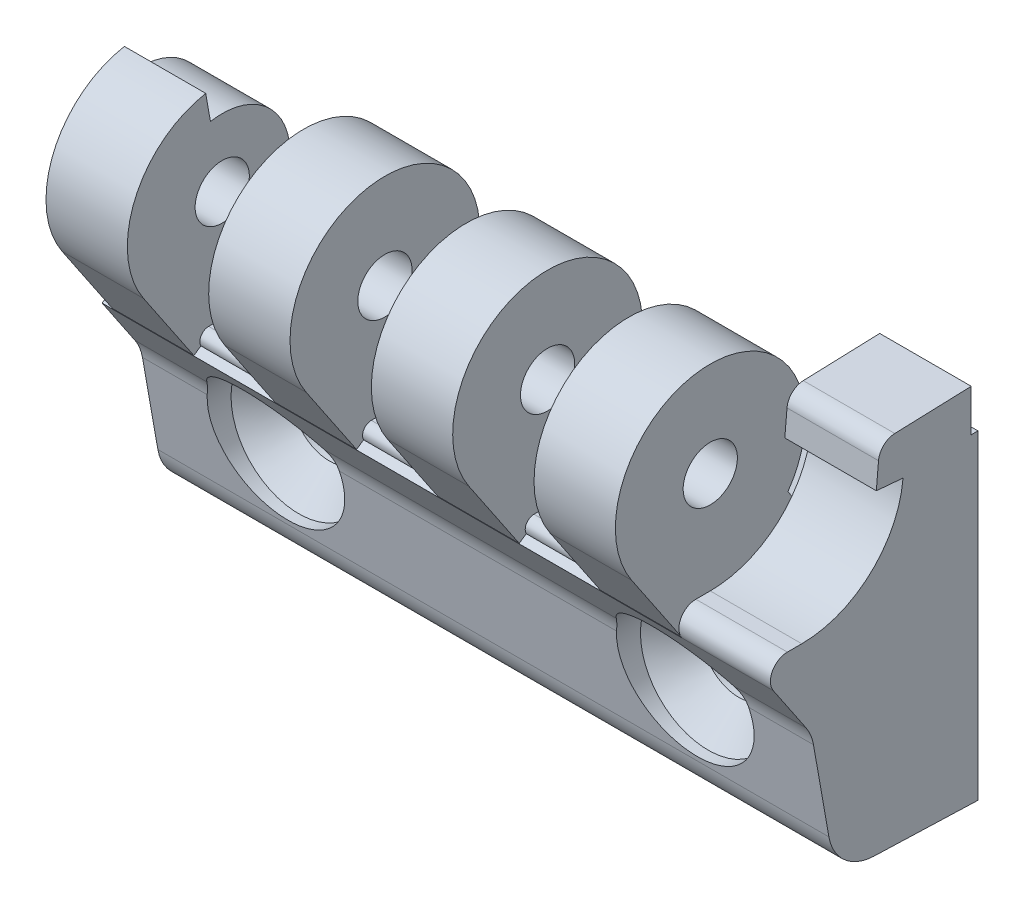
ISO-10303-21;
HEADER;
FILE_DESCRIPTION(('STEP AP214'),'2;1');
FILE_NAME('part.step','',(''),(''),'','','');
FILE_SCHEMA(('AUTOMOTIVE_DESIGN { 1 0 10303 214 1 1 1 1 }'));
ENDSEC;
DATA;
#1=APPLICATION_CONTEXT('core data for automotive mechanical design processes');
#2=APPLICATION_PROTOCOL_DEFINITION('international standard','automotive_design',2000,#1);
#3=PRODUCT_CONTEXT('',#1,'mechanical');
#4=PRODUCT('Part','Part','',(#3));
#5=PRODUCT_RELATED_PRODUCT_CATEGORY('part','',(#4));
#6=PRODUCT_DEFINITION_FORMATION('','',#4);
#7=PRODUCT_DEFINITION_CONTEXT('part definition',#1,'design');
#8=PRODUCT_DEFINITION('design','',#6,#7);
#9=PRODUCT_DEFINITION_SHAPE('','',#8);
#10=(LENGTH_UNIT() NAMED_UNIT(*) SI_UNIT(.MILLI.,.METRE.));
#11=(NAMED_UNIT(*) PLANE_ANGLE_UNIT() SI_UNIT($,.RADIAN.));
#12=(NAMED_UNIT(*) SI_UNIT($,.STERADIAN.) SOLID_ANGLE_UNIT());
#13=UNCERTAINTY_MEASURE_WITH_UNIT(LENGTH_MEASURE(1.E-05),#10,'distance_accuracy_value','');
#14=(GEOMETRIC_REPRESENTATION_CONTEXT(3) GLOBAL_UNCERTAINTY_ASSIGNED_CONTEXT((#13)) GLOBAL_UNIT_ASSIGNED_CONTEXT((#10,
#11,#12)) REPRESENTATION_CONTEXT('',''));
#15=CARTESIAN_POINT('',(0.,0.,0.));
#16=DIRECTION('',(0.,0.,1.));
#17=DIRECTION('',(1.,0.,0.));
#18=AXIS2_PLACEMENT_3D('',#15,#16,#17);
#19=CARTESIAN_POINT('',(33.1,6.75,14.));
#20=DIRECTION('',(1.,0.,0.));
#21=DIRECTION('',(0.,1.,0.));
#22=AXIS2_PLACEMENT_3D('',#19,#20,#21);
#23=CYLINDRICAL_SURFACE('',#22,0.65);
#24=CARTESIAN_POINT('',(9.1,6.75,14.));
#25=DIRECTION('',(1.,0.,0.));
#26=DIRECTION('',(0.,1.,0.));
#27=AXIS2_PLACEMENT_3D('',#24,#25,#26);
#28=CIRCLE('',#27,0.65);
#29=CARTESIAN_POINT('',(9.1,7.39999933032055,14.0009330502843));
#30=VERTEX_POINT('',#29);
#31=CARTESIAN_POINT('',(9.1,6.43759001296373,14.57));
#32=VERTEX_POINT('',#31);
#33=EDGE_CURVE('E387',#30,#32,#28,.T.);
#34=ORIENTED_EDGE('',*,*,#33,.T.);
#35=DIRECTION('',(-1.,0.,0.));
#36=VECTOR('',#35,1.);
#37=CARTESIAN_POINT('',(33.1,6.43759001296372,14.57));
#38=LINE('',#37,#36);
#39=CARTESIAN_POINT('',(15.1,6.43759001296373,14.57));
#40=VERTEX_POINT('',#39);
#41=EDGE_CURVE('E385',#32,#40,#38,.F.);
#42=ORIENTED_EDGE('',*,*,#41,.T.);
#43=CARTESIAN_POINT('',(15.1,6.75,14.));
#44=DIRECTION('',(1.,0.,0.));
#45=DIRECTION('',(0.,1.,0.));
#46=AXIS2_PLACEMENT_3D('',#43,#44,#45);
#47=CIRCLE('',#46,0.65);
#48=CARTESIAN_POINT('',(15.1,7.39999933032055,14.0009330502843));
#49=VERTEX_POINT('',#48);
#50=EDGE_CURVE('E18',#40,#49,#47,.F.);
#51=ORIENTED_EDGE('',*,*,#50,.T.);
#52=DIRECTION('',(-1.,0.,0.));
#53=VECTOR('',#52,1.);
#54=CARTESIAN_POINT('',(33.1,7.39999933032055,14.0009330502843));
#55=LINE('',#54,#53);
#56=EDGE_CURVE('E382',#49,#30,#55,.T.);
#57=ORIENTED_EDGE('',*,*,#56,.T.);
#58=EDGE_LOOP('',(#34,#42,#51,#57));
#59=FACE_BOUND('',#58,.T.);
#60=ADVANCED_FACE('F15',(#59),#23,.T.);
#61=CARTESIAN_POINT('',(33.1,6.75,14.));
#62=DIRECTION('',(1.,0.,0.));
#63=DIRECTION('',(0.,1.,0.));
#64=AXIS2_PLACEMENT_3D('',#61,#62,#63);
#65=CYLINDRICAL_SURFACE('',#64,0.65);
#66=CARTESIAN_POINT('',(-2.9,6.75,14.));
#67=DIRECTION('',(1.,0.,0.));
#68=DIRECTION('',(0.,1.,0.));
#69=AXIS2_PLACEMENT_3D('',#66,#67,#68);
#70=CIRCLE('',#69,0.65);
#71=CARTESIAN_POINT('',(-2.9,7.39999933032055,14.0009330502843));
#72=VERTEX_POINT('',#71);
#73=CARTESIAN_POINT('',(-2.9,6.43759001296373,14.57));
#74=VERTEX_POINT('',#73);
#75=EDGE_CURVE('E560',#72,#74,#70,.T.);
#76=ORIENTED_EDGE('',*,*,#75,.T.);
#77=DIRECTION('',(-1.,0.,0.));
#78=VECTOR('',#77,1.);
#79=CARTESIAN_POINT('',(33.1,6.43759001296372,14.57));
#80=LINE('',#79,#78);
#81=CARTESIAN_POINT('',(3.1,6.43759001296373,14.57));
#82=VERTEX_POINT('',#81);
#83=EDGE_CURVE('E532',#74,#82,#80,.F.);
#84=ORIENTED_EDGE('',*,*,#83,.T.);
#85=CARTESIAN_POINT('',(3.1,6.75,14.));
#86=DIRECTION('',(1.,0.,0.));
#87=DIRECTION('',(0.,1.,0.));
#88=AXIS2_PLACEMENT_3D('',#85,#86,#87);
#89=CIRCLE('',#88,0.65);
#90=CARTESIAN_POINT('',(3.1,7.39999933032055,14.0009330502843));
#91=VERTEX_POINT('',#90);
#92=EDGE_CURVE('E1422',#82,#91,#89,.F.);
#93=ORIENTED_EDGE('',*,*,#92,.T.);
#94=DIRECTION('',(-1.,0.,0.));
#95=VECTOR('',#94,1.);
#96=CARTESIAN_POINT('',(33.1,7.39999933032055,14.0009330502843));
#97=LINE('',#96,#95);
#98=EDGE_CURVE('E527',#91,#72,#97,.T.);
#99=ORIENTED_EDGE('',*,*,#98,.T.);
#100=EDGE_LOOP('',(#76,#84,#93,#99));
#101=FACE_BOUND('',#100,.T.);
#102=ADVANCED_FACE('F1412',(#101),#65,.T.);
#103=CARTESIAN_POINT('',(9.1,15.5,13.));
#104=DIRECTION('',(1.,0.,0.));
#105=DIRECTION('',(0.,1.,0.));
#106=AXIS2_PLACEMENT_3D('',#103,#104,#105);
#107=CYLINDRICAL_SURFACE('',#106,2.);
#108=CARTESIAN_POINT('',(3.1,15.5,13.));
#109=DIRECTION('',(1.,0.,0.));
#110=DIRECTION('',(0.,1.,0.));
#111=AXIS2_PLACEMENT_3D('',#108,#109,#110);
#112=CIRCLE('',#111,2.);
#113=CARTESIAN_POINT('',(3.1,17.5,13.));
#114=VERTEX_POINT('',#113);
#115=EDGE_CURVE('E530',#114,#114,#112,.F.);
#116=ORIENTED_EDGE('',*,*,#115,.T.);
#117=EDGE_LOOP('',(#116));
#118=FACE_BOUND('',#117,.T.);
#119=CARTESIAN_POINT('',(9.1,15.5,13.));
#120=DIRECTION('',(1.,0.,0.));
#121=DIRECTION('',(0.,1.,0.));
#122=AXIS2_PLACEMENT_3D('',#119,#120,#121);
#123=CIRCLE('',#122,2.);
#124=CARTESIAN_POINT('',(9.1,17.5,13.));
#125=VERTEX_POINT('',#124);
#126=EDGE_CURVE('E403',#125,#125,#123,.F.);
#127=ORIENTED_EDGE('',*,*,#126,.F.);
#128=EDGE_LOOP('',(#127));
#129=FACE_BOUND('',#128,.T.);
#130=ADVANCED_FACE('F1409',(#118,#129),#107,.F.);
#131=CARTESIAN_POINT('',(9.1,11.5856496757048,18.8032630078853));
#132=DIRECTION('',(0.,-0.559192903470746,0.829037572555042));
#133=DIRECTION('',(0.,0.829037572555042,0.559192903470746));
#134=AXIS2_PLACEMENT_3D('',#131,#132,#133);
#135=PLANE('',#134);
#136=DIRECTION('',(-1.,0.,0.));
#137=VECTOR('',#136,1.);
#138=CARTESIAN_POINT('',(9.1,11.5856496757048,18.8032630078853));
#139=LINE('',#138,#137);
#140=CARTESIAN_POINT('',(9.1,11.5856496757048,18.8032630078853));
#141=VERTEX_POINT('',#140);
#142=CARTESIAN_POINT('',(3.1,11.5856496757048,18.8032630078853));
#143=VERTEX_POINT('',#142);
#144=EDGE_CURVE('E549',#141,#143,#139,.T.);
#145=ORIENTED_EDGE('',*,*,#144,.T.);
#146=DIRECTION('',(0.,-0.829037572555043,-0.559192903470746));
#147=VECTOR('',#146,1.);
#148=CARTESIAN_POINT('',(3.1,11.5856496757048,18.8032630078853));
#149=LINE('',#148,#147);
#150=CARTESIAN_POINT('',(3.1,6.08486474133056,15.0929367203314));
#151=VERTEX_POINT('',#150);
#152=EDGE_CURVE('E719',#143,#151,#149,.T.);
#153=ORIENTED_EDGE('',*,*,#152,.T.);
#154=DIRECTION('',(-1.,0.,0.));
#155=VECTOR('',#154,1.);
#156=CARTESIAN_POINT('',(33.1,6.08486474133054,15.0929367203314));
#157=LINE('',#156,#155);
#158=CARTESIAN_POINT('',(9.1,6.08486474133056,15.0929367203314));
#159=VERTEX_POINT('',#158);
#160=EDGE_CURVE('E535',#151,#159,#157,.F.);
#161=ORIENTED_EDGE('',*,*,#160,.T.);
#162=DIRECTION('',(0.,-0.829037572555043,-0.559192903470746));
#163=VECTOR('',#162,1.);
#164=CARTESIAN_POINT('',(9.1,11.5856496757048,18.8032630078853));
#165=LINE('',#164,#163);
#166=EDGE_CURVE('E425',#141,#159,#165,.T.);
#167=ORIENTED_EDGE('',*,*,#166,.F.);
#168=EDGE_LOOP('',(#145,#153,#161,#167));
#169=FACE_BOUND('',#168,.T.);
#170=ADVANCED_FACE('F1405',(#169),#135,.T.);
#171=CARTESIAN_POINT('',(-2.9,15.5,13.));
#172=DIRECTION('',(1.,0.,0.));
#173=DIRECTION('',(0.,1.,0.));
#174=AXIS2_PLACEMENT_3D('',#171,#172,#173);
#175=CYLINDRICAL_SURFACE('',#174,5.);
#176=CARTESIAN_POINT('',(-2.9,15.5,13.));
#177=DIRECTION('',(1.,0.,0.));
#178=DIRECTION('',(0.,1.,0.));
#179=AXIS2_PLACEMENT_3D('',#176,#177,#178);
#180=CIRCLE('',#179,5.);
#181=CARTESIAN_POINT('',(-2.9,14.4120549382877,8.11979759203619));
#182=VERTEX_POINT('',#181);
#183=CARTESIAN_POINT('',(-2.9,20.424038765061,13.8682408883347));
#184=VERTEX_POINT('',#183);
#185=EDGE_CURVE('E699',#182,#184,#180,.T.);
#186=ORIENTED_EDGE('',*,*,#185,.F.);
#187=DIRECTION('',(1.,0.,0.));
#188=VECTOR('',#187,1.);
#189=CARTESIAN_POINT('',(-2.9,14.4120549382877,8.11979759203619));
#190=LINE('',#189,#188);
#191=CARTESIAN_POINT('',(-8.9,14.4120549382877,8.11979759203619));
#192=VERTEX_POINT('',#191);
#193=EDGE_CURVE('E550',#182,#192,#190,.F.);
#194=ORIENTED_EDGE('',*,*,#193,.T.);
#195=CARTESIAN_POINT('',(-8.9,15.5,13.));
#196=DIRECTION('',(1.,0.,0.));
#197=DIRECTION('',(0.,1.,0.));
#198=AXIS2_PLACEMENT_3D('',#195,#196,#197);
#199=CIRCLE('',#198,5.);
#200=CARTESIAN_POINT('',(-8.9,20.424038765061,13.8682408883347));
#201=VERTEX_POINT('',#200);
#202=EDGE_CURVE('E711',#192,#201,#199,.T.);
#203=ORIENTED_EDGE('',*,*,#202,.T.);
#204=DIRECTION('',(-1.,0.,0.));
#205=VECTOR('',#204,1.);
#206=CARTESIAN_POINT('',(-2.9,20.424038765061,13.8682408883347));
#207=LINE('',#206,#205);
#208=EDGE_CURVE('E546',#184,#201,#207,.T.);
#209=ORIENTED_EDGE('',*,*,#208,.F.);
#210=EDGE_LOOP('',(#186,#194,#203,#209));
#211=FACE_BOUND('',#210,.T.);
#212=ADVANCED_FACE('F1401',(#211),#175,.T.);
#213=CARTESIAN_POINT('',(-2.9,20.424038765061,13.8682408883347));
#214=DIRECTION('',(0.,0.17364817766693,-0.984807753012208));
#215=DIRECTION('',(0.,-0.984807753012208,-0.17364817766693));
#216=AXIS2_PLACEMENT_3D('',#213,#214,#215);
#217=PLANE('',#216);
#218=DIRECTION('',(0.,0.984807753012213,0.173648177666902));
#219=VECTOR('',#218,1.);
#220=CARTESIAN_POINT('',(-2.9,20.424038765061,13.8682408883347));
#221=LINE('',#220,#219);
#222=CARTESIAN_POINT('',(-2.9,22.3936542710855,14.2155372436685));
#223=VERTEX_POINT('',#222);
#224=EDGE_CURVE('E698',#184,#223,#221,.T.);
#225=ORIENTED_EDGE('',*,*,#224,.F.);
#226=ORIENTED_EDGE('',*,*,#208,.T.);
#227=DIRECTION('',(0.,0.984807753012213,0.173648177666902));
#228=VECTOR('',#227,1.);
#229=CARTESIAN_POINT('',(-8.9,20.424038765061,13.8682408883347));
#230=LINE('',#229,#228);
#231=CARTESIAN_POINT('',(-8.9,22.3936542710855,14.2155372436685));
#232=VERTEX_POINT('',#231);
#233=EDGE_CURVE('E710',#201,#232,#230,.T.);
#234=ORIENTED_EDGE('',*,*,#233,.T.);
#235=DIRECTION('',(1.,0.,0.));
#236=VECTOR('',#235,1.);
#237=CARTESIAN_POINT('',(-2.9,22.3936542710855,14.2155372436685));
#238=LINE('',#237,#236);
#239=EDGE_CURVE('E543',#223,#232,#238,.F.);
#240=ORIENTED_EDGE('',*,*,#239,.F.);
#241=EDGE_LOOP('',(#225,#226,#234,#240));
#242=FACE_BOUND('',#241,.T.);
#243=ADVANCED_FACE('F1397',(#242),#217,.T.);
#244=CARTESIAN_POINT('',(-2.9,15.5,13.));
#245=DIRECTION('',(1.,0.,0.));
#246=DIRECTION('',(0.,1.,0.));
#247=AXIS2_PLACEMENT_3D('',#244,#245,#246);
#248=CYLINDRICAL_SURFACE('',#247,7.);
#249=CARTESIAN_POINT('',(-2.9,15.5,13.));
#250=DIRECTION('',(1.,0.,0.));
#251=DIRECTION('',(0.,1.,0.));
#252=AXIS2_PLACEMENT_3D('',#249,#250,#251);
#253=CIRCLE('',#252,7.);
#254=CARTESIAN_POINT('',(-2.9,11.5856496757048,18.8032630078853));
#255=VERTEX_POINT('',#254);
#256=EDGE_CURVE('E694',#223,#255,#253,.T.);
#257=ORIENTED_EDGE('',*,*,#256,.F.);
#258=ORIENTED_EDGE('',*,*,#239,.T.);
#259=CARTESIAN_POINT('',(-8.9,15.5,13.));
#260=DIRECTION('',(1.,0.,0.));
#261=DIRECTION('',(0.,1.,0.));
#262=AXIS2_PLACEMENT_3D('',#259,#260,#261);
#263=CIRCLE('',#262,7.);
#264=CARTESIAN_POINT('',(-8.9,11.5856496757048,18.8032630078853));
#265=VERTEX_POINT('',#264);
#266=EDGE_CURVE('E707',#232,#265,#263,.T.);
#267=ORIENTED_EDGE('',*,*,#266,.T.);
#268=DIRECTION('',(-1.,0.,0.));
#269=VECTOR('',#268,1.);
#270=CARTESIAN_POINT('',(-2.9,11.5856496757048,18.8032630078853));
#271=LINE('',#270,#269);
#272=EDGE_CURVE('E540',#255,#265,#271,.T.);
#273=ORIENTED_EDGE('',*,*,#272,.F.);
#274=EDGE_LOOP('',(#257,#258,#267,#273));
#275=FACE_BOUND('',#274,.T.);
#276=ADVANCED_FACE('F1393',(#275),#248,.T.);
#277=CARTESIAN_POINT('',(-2.9,11.5856496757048,18.8032630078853));
#278=DIRECTION('',(0.,-0.559192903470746,0.829037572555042));
#279=DIRECTION('',(0.,0.829037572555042,0.559192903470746));
#280=AXIS2_PLACEMENT_3D('',#277,#278,#279);
#281=PLANE('',#280);
#282=ORIENTED_EDGE('',*,*,#272,.T.);
#283=DIRECTION('',(0.,-0.829037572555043,-0.559192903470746));
#284=VECTOR('',#283,1.);
#285=CARTESIAN_POINT('',(-8.9,11.5856496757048,18.8032630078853));
#286=LINE('',#285,#284);
#287=CARTESIAN_POINT('',(-8.9,6.08486474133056,15.0929367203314));
#288=VERTEX_POINT('',#287);
#289=EDGE_CURVE('E709',#265,#288,#286,.T.);
#290=ORIENTED_EDGE('',*,*,#289,.T.);
#291=DIRECTION('',(-1.,0.,0.));
#292=VECTOR('',#291,1.);
#293=CARTESIAN_POINT('',(33.1,6.08486474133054,15.0929367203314));
#294=LINE('',#293,#292);
#295=CARTESIAN_POINT('',(-2.9,6.08486474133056,15.0929367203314));
#296=VERTEX_POINT('',#295);
#297=EDGE_CURVE('E536',#288,#296,#294,.F.);
#298=ORIENTED_EDGE('',*,*,#297,.T.);
#299=DIRECTION('',(0.,-0.829037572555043,-0.559192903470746));
#300=VECTOR('',#299,1.);
#301=CARTESIAN_POINT('',(-2.9,11.5856496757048,18.8032630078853));
#302=LINE('',#301,#300);
#303=EDGE_CURVE('E697',#255,#296,#302,.T.);
#304=ORIENTED_EDGE('',*,*,#303,.F.);
#305=EDGE_LOOP('',(#282,#290,#298,#304));
#306=FACE_BOUND('',#305,.T.);
#307=ADVANCED_FACE('F1389',(#306),#281,.T.);
#308=CARTESIAN_POINT('',(-2.9,15.5,13.));
#309=DIRECTION('',(1.,0.,0.));
#310=DIRECTION('',(0.,1.,0.));
#311=AXIS2_PLACEMENT_3D('',#308,#309,#310);
#312=CYLINDRICAL_SURFACE('',#311,2.);
#313=CARTESIAN_POINT('',(-8.9,15.5,13.));
#314=DIRECTION('',(1.,0.,0.));
#315=DIRECTION('',(0.,1.,0.));
#316=AXIS2_PLACEMENT_3D('',#313,#314,#315);
#317=CIRCLE('',#316,2.);
#318=CARTESIAN_POINT('',(-8.9,17.5,13.));
#319=VERTEX_POINT('',#318);
#320=EDGE_CURVE('E713',#319,#319,#317,.F.);
#321=ORIENTED_EDGE('',*,*,#320,.T.);
#322=EDGE_LOOP('',(#321));
#323=FACE_BOUND('',#322,.T.);
#324=CARTESIAN_POINT('',(-2.9,15.5,13.));
#325=DIRECTION('',(1.,0.,0.));
#326=DIRECTION('',(0.,1.,0.));
#327=AXIS2_PLACEMENT_3D('',#324,#325,#326);
#328=CIRCLE('',#327,2.);
#329=CARTESIAN_POINT('',(-2.9,17.5,13.));
#330=VERTEX_POINT('',#329);
#331=EDGE_CURVE('E690',#330,#330,#328,.F.);
#332=ORIENTED_EDGE('',*,*,#331,.F.);
#333=EDGE_LOOP('',(#332));
#334=FACE_BOUND('',#333,.T.);
#335=ADVANCED_FACE('F1385',(#323,#334),#312,.F.);
#336=CARTESIAN_POINT('',(33.1,15.5,13.));
#337=DIRECTION('',(1.,0.,0.));
#338=DIRECTION('',(0.,1.,0.));
#339=AXIS2_PLACEMENT_3D('',#336,#337,#338);
#340=CYLINDRICAL_SURFACE('',#339,2.);
#341=CARTESIAN_POINT('',(27.1,15.5,13.));
#342=DIRECTION('',(1.,0.,0.));
#343=DIRECTION('',(0.,1.,0.));
#344=AXIS2_PLACEMENT_3D('',#341,#342,#343);
#345=CIRCLE('',#344,2.);
#346=CARTESIAN_POINT('',(27.1,17.5,13.));
#347=VERTEX_POINT('',#346);
#348=EDGE_CURVE('E686',#347,#347,#345,.F.);
#349=ORIENTED_EDGE('',*,*,#348,.T.);
#350=EDGE_LOOP('',(#349));
#351=FACE_BOUND('',#350,.T.);
#352=CARTESIAN_POINT('',(33.1,15.5,13.));
#353=DIRECTION('',(1.,0.,0.));
#354=DIRECTION('',(0.,1.,0.));
#355=AXIS2_PLACEMENT_3D('',#352,#353,#354);
#356=CIRCLE('',#355,2.);
#357=CARTESIAN_POINT('',(33.1,17.5,13.));
#358=VERTEX_POINT('',#357);
#359=EDGE_CURVE('E485',#358,#358,#356,.F.);
#360=ORIENTED_EDGE('',*,*,#359,.F.);
#361=EDGE_LOOP('',(#360));
#362=FACE_BOUND('',#361,.T.);
#363=ADVANCED_FACE('F1382',(#351,#362),#340,.F.);
#364=CARTESIAN_POINT('',(33.1,11.5856496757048,18.8032630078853));
#365=DIRECTION('',(0.,-0.559192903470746,0.829037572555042));
#366=DIRECTION('',(0.,0.829037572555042,0.559192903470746));
#367=AXIS2_PLACEMENT_3D('',#364,#365,#366);
#368=PLANE('',#367);
#369=DIRECTION('',(1.,0.,0.));
#370=VECTOR('',#369,1.);
#371=CARTESIAN_POINT('',(33.1,11.5856496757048,18.8032630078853));
#372=LINE('',#371,#370);
#373=CARTESIAN_POINT('',(27.1,11.5856496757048,18.8032630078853));
#374=VERTEX_POINT('',#373);
#375=CARTESIAN_POINT('',(33.1,11.5856496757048,18.8032630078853));
#376=VERTEX_POINT('',#375);
#377=EDGE_CURVE('E493',#374,#376,#372,.T.);
#378=ORIENTED_EDGE('',*,*,#377,.F.);
#379=DIRECTION('',(0.,-0.829037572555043,-0.559192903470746));
#380=VECTOR('',#379,1.);
#381=CARTESIAN_POINT('',(27.1,11.5856496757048,18.8032630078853));
#382=LINE('',#381,#380);
#383=CARTESIAN_POINT('',(27.1,6.08486474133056,15.0929367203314));
#384=VERTEX_POINT('',#383);
#385=EDGE_CURVE('E689',#374,#384,#382,.T.);
#386=ORIENTED_EDGE('',*,*,#385,.T.);
#387=DIRECTION('',(-1.,0.,0.));
#388=VECTOR('',#387,1.);
#389=CARTESIAN_POINT('',(33.1,6.08486474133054,15.0929367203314));
#390=LINE('',#389,#388);
#391=CARTESIAN_POINT('',(33.1,6.08486474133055,15.0929367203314));
#392=VERTEX_POINT('',#391);
#393=EDGE_CURVE('E479',#384,#392,#390,.F.);
#394=ORIENTED_EDGE('',*,*,#393,.T.);
#395=DIRECTION('',(0.,0.82903757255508,0.55919290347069));
#396=VECTOR('',#395,1.);
#397=CARTESIAN_POINT('',(33.1,6.08486474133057,15.0929367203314));
#398=LINE('',#397,#396);
#399=CARTESIAN_POINT('',(33.1,6.26475642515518,15.2142751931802));
#400=VERTEX_POINT('',#399);
#401=EDGE_CURVE('E482',#392,#400,#398,.T.);
#402=ORIENTED_EDGE('',*,*,#401,.T.);
#403=DIRECTION('',(0.,-0.829037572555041,-0.559192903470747));
#404=VECTOR('',#403,1.);
#405=CARTESIAN_POINT('',(33.1,11.5856496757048,18.8032630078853));
#406=LINE('',#405,#404);
#407=EDGE_CURVE('E490',#376,#400,#406,.T.);
#408=ORIENTED_EDGE('',*,*,#407,.F.);
#409=EDGE_LOOP('',(#378,#386,#394,#402,#408));
#410=FACE_BOUND('',#409,.T.);
#411=ADVANCED_FACE('F1317',(#410),#368,.T.);
#412=CARTESIAN_POINT('',(33.1,6.75,14.));
#413=DIRECTION('',(1.,0.,0.));
#414=DIRECTION('',(0.,1.,0.));
#415=AXIS2_PLACEMENT_3D('',#412,#413,#414);
#416=CYLINDRICAL_SURFACE('',#415,0.65);
#417=CARTESIAN_POINT('',(27.1,6.75,14.));
#418=DIRECTION('',(1.,0.,0.));
#419=DIRECTION('',(0.,1.,0.));
#420=AXIS2_PLACEMENT_3D('',#417,#418,#419);
#421=CIRCLE('',#420,0.65);
#422=CARTESIAN_POINT('',(27.1,6.43759001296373,14.57));
#423=VERTEX_POINT('',#422);
#424=CARTESIAN_POINT('',(27.1,7.39999933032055,14.0009330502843));
#425=VERTEX_POINT('',#424);
#426=EDGE_CURVE('E682',#423,#425,#421,.F.);
#427=ORIENTED_EDGE('',*,*,#426,.T.);
#428=DIRECTION('',(-1.,0.,0.));
#429=VECTOR('',#428,1.);
#430=CARTESIAN_POINT('',(33.1,7.39999933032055,14.0009330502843));
#431=LINE('',#430,#429);
#432=CARTESIAN_POINT('',(21.1,7.39999933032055,14.0009330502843));
#433=VERTEX_POINT('',#432);
#434=EDGE_CURVE('E513',#425,#433,#431,.T.);
#435=ORIENTED_EDGE('',*,*,#434,.T.);
#436=CARTESIAN_POINT('',(21.1,6.75,14.));
#437=DIRECTION('',(1.,0.,0.));
#438=DIRECTION('',(0.,1.,0.));
#439=AXIS2_PLACEMENT_3D('',#436,#437,#438);
#440=CIRCLE('',#439,0.65);
#441=CARTESIAN_POINT('',(21.1,6.43759001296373,14.57));
#442=VERTEX_POINT('',#441);
#443=EDGE_CURVE('E512',#433,#442,#440,.T.);
#444=ORIENTED_EDGE('',*,*,#443,.T.);
#445=DIRECTION('',(-1.,0.,0.));
#446=VECTOR('',#445,1.);
#447=CARTESIAN_POINT('',(33.1,6.43759001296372,14.57));
#448=LINE('',#447,#446);
#449=EDGE_CURVE('E484',#442,#423,#448,.F.);
#450=ORIENTED_EDGE('',*,*,#449,.T.);
#451=EDGE_LOOP('',(#427,#435,#444,#450));
#452=FACE_BOUND('',#451,.T.);
#453=ADVANCED_FACE('F1309',(#452),#416,.T.);
#454=CARTESIAN_POINT('',(15.1,15.5,13.));
#455=DIRECTION('',(-1.,0.,0.));
#456=DIRECTION('',(0.,-1.,0.));
#457=AXIS2_PLACEMENT_3D('',#454,#455,#456);
#458=CYLINDRICAL_SURFACE('',#457,2.);
#459=CARTESIAN_POINT('',(15.1,15.5,13.));
#460=DIRECTION('',(-1.,0.,0.));
#461=DIRECTION('',(0.,-1.,0.));
#462=AXIS2_PLACEMENT_3D('',#459,#460,#461);
#463=CIRCLE('',#462,2.);
#464=CARTESIAN_POINT('',(15.1,13.5,13.));
#465=VERTEX_POINT('',#464);
#466=EDGE_CURVE('E724',#465,#465,#463,.T.);
#467=ORIENTED_EDGE('',*,*,#466,.T.);
#468=EDGE_LOOP('',(#467));
#469=FACE_BOUND('',#468,.T.);
#470=CARTESIAN_POINT('',(21.1,15.5,13.));
#471=DIRECTION('',(-1.,0.,0.));
#472=DIRECTION('',(0.,-1.,0.));
#473=AXIS2_PLACEMENT_3D('',#470,#471,#472);
#474=CIRCLE('',#473,2.);
#475=CARTESIAN_POINT('',(21.1,13.5,13.));
#476=VERTEX_POINT('',#475);
#477=EDGE_CURVE('E516',#476,#476,#474,.T.);
#478=ORIENTED_EDGE('',*,*,#477,.F.);
#479=EDGE_LOOP('',(#478));
#480=FACE_BOUND('',#479,.T.);
#481=ADVANCED_FACE('F1374',(#469,#480),#458,.F.);
#482=CARTESIAN_POINT('',(15.1,3.2952739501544,13.2113339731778));
#483=DIRECTION('',(0.,-0.559192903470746,0.829037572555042));
#484=DIRECTION('',(0.,0.829037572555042,0.559192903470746));
#485=AXIS2_PLACEMENT_3D('',#482,#483,#484);
#486=PLANE('',#485);
#487=DIRECTION('',(-1.,0.,0.));
#488=VECTOR('',#487,1.);
#489=CARTESIAN_POINT('',(15.1,11.5856496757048,18.8032630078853));
#490=LINE('',#489,#488);
#491=CARTESIAN_POINT('',(21.1,11.5856496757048,18.8032630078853));
#492=VERTEX_POINT('',#491);
#493=CARTESIAN_POINT('',(15.1,11.5856496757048,18.8032630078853));
#494=VERTEX_POINT('',#493);
#495=EDGE_CURVE('E509',#492,#494,#490,.T.);
#496=ORIENTED_EDGE('',*,*,#495,.T.);
#497=DIRECTION('',(0.,-0.829037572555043,-0.559192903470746));
#498=VECTOR('',#497,1.);
#499=CARTESIAN_POINT('',(15.1,11.5856496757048,18.8032630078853));
#500=LINE('',#499,#498);
#501=CARTESIAN_POINT('',(15.1,6.08486474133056,15.0929367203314));
#502=VERTEX_POINT('',#501);
#503=EDGE_CURVE('E728',#494,#502,#500,.T.);
#504=ORIENTED_EDGE('',*,*,#503,.T.);
#505=DIRECTION('',(-1.,0.,0.));
#506=VECTOR('',#505,1.);
#507=CARTESIAN_POINT('',(33.1,6.08486474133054,15.0929367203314));
#508=LINE('',#507,#506);
#509=CARTESIAN_POINT('',(21.1,6.08486474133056,15.0929367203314));
#510=VERTEX_POINT('',#509);
#511=EDGE_CURVE('E468',#502,#510,#508,.F.);
#512=ORIENTED_EDGE('',*,*,#511,.T.);
#513=DIRECTION('',(0.,-0.829037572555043,-0.559192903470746));
#514=VECTOR('',#513,1.);
#515=CARTESIAN_POINT('',(21.1,11.5856496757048,18.8032630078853));
#516=LINE('',#515,#514);
#517=EDGE_CURVE('E508',#492,#510,#516,.T.);
#518=ORIENTED_EDGE('',*,*,#517,.F.);
#519=EDGE_LOOP('',(#496,#504,#512,#518));
#520=FACE_BOUND('',#519,.T.);
#521=ADVANCED_FACE('F1370',(#520),#486,.T.);
#522=CARTESIAN_POINT('',(33.1,15.5,0.));
#523=DIRECTION('',(1.,0.,0.));
#524=DIRECTION('',(0.,1.,0.));
#525=AXIS2_PLACEMENT_3D('',#522,#523,#524);
#526=PLANE('',#525);
#527=ORIENTED_EDGE('',*,*,#359,.T.);
#528=EDGE_LOOP('',(#527));
#529=FACE_BOUND('',#528,.T.);
#530=DIRECTION('',(0.,0.0871557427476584,0.996194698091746));
#531=VECTOR('',#530,1.);
#532=CARTESIAN_POINT('',(33.1,15.0225084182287,7.5));
#533=LINE('',#532,#531);
#534=CARTESIAN_POINT('',(33.1,15.0225084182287,7.5));
#535=VERTEX_POINT('',#534);
#536=CARTESIAN_POINT('',(33.1,14.8935778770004,6.02631717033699));
#537=VERTEX_POINT('',#536);
#538=EDGE_CURVE('E1108',#535,#537,#533,.F.);
#539=ORIENTED_EDGE('',*,*,#538,.F.);
#540=DIRECTION('',(0.,0.996194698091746,-0.0871557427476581));
#541=VECTOR('',#540,1.);
#542=CARTESIAN_POINT('',(33.1,16.8628447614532,7.33899143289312));
#543=LINE('',#542,#541);
#544=CARTESIAN_POINT('',(33.1,16.8628447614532,7.33899143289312));
#545=VERTEX_POINT('',#544);
#546=EDGE_CURVE('E494',#545,#535,#543,.F.);
#547=ORIENTED_EDGE('',*,*,#546,.F.);
#548=CARTESIAN_POINT('',(33.1,16.7539000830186,6.09374806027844));
#549=DIRECTION('',(1.,0.,0.));
#550=DIRECTION('',(0.,1.,0.));
#551=AXIS2_PLACEMENT_3D('',#548,#549,#550);
#552=CIRCLE('',#551,1.25);
#553=CARTESIAN_POINT('',(33.1,17.9537783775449,6.44416506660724));
#554=VERTEX_POINT('',#553);
#555=EDGE_CURVE('E664',#554,#545,#552,.T.);
#556=ORIENTED_EDGE('',*,*,#555,.F.);
#557=CARTESIAN_POINT('',(33.1,15.5,13.));
#558=DIRECTION('',(1.,0.,0.));
#559=DIRECTION('',(0.,1.,0.));
#560=AXIS2_PLACEMENT_3D('',#557,#558,#559);
#561=CIRCLE('',#560,7.);
#562=EDGE_CURVE('E504',#376,#554,#561,.F.);
#563=ORIENTED_EDGE('',*,*,#562,.F.);
#564=ORIENTED_EDGE('',*,*,#407,.T.);
#565=CARTESIAN_POINT('',(33.1,6.75,14.0623035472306));
#566=DIRECTION('',(1.,0.,0.));
#567=DIRECTION('',(0.,1.,0.));
#568=AXIS2_PLACEMENT_3D('',#565,#566,#567);
#569=CIRCLE('',#568,1.25);
#570=CARTESIAN_POINT('',(33.1,8.,14.0623035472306));
#571=VERTEX_POINT('',#570);
#572=EDGE_CURVE('E657',#571,#400,#569,.T.);
#573=ORIENTED_EDGE('',*,*,#572,.F.);
#574=DIRECTION('',(0.,0.,1.));
#575=VECTOR('',#574,1.);
#576=CARTESIAN_POINT('',(33.1,8.,13.));
#577=LINE('',#576,#575);
#578=CARTESIAN_POINT('',(33.1,8.,13.));
#579=VERTEX_POINT('',#578);
#580=EDGE_CURVE('E465',#579,#571,#577,.T.);
#581=ORIENTED_EDGE('',*,*,#580,.F.);
#582=CARTESIAN_POINT('',(33.1,15.5,13.));
#583=DIRECTION('',(1.,0.,0.));
#584=DIRECTION('',(0.,1.,0.));
#585=AXIS2_PLACEMENT_3D('',#582,#583,#584);
#586=CIRCLE('',#585,7.5);
#587=CARTESIAN_POINT('',(33.1,11.0358013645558,6.9733151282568));
#588=VERTEX_POINT('',#587);
#589=EDGE_CURVE('E660',#579,#588,#586,.T.);
#590=ORIENTED_EDGE('',*,*,#589,.T.);
#591=DIRECTION('',(0.,0.829037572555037,0.559192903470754));
#592=VECTOR('',#591,1.);
#593=CARTESIAN_POINT('',(33.1,11.0358013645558,6.9733151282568));
#594=LINE('',#593,#592);
#595=CARTESIAN_POINT('',(33.1,11.4774457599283,7.27120803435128));
#596=VERTEX_POINT('',#595);
#597=EDGE_CURVE('E488',#588,#596,#594,.T.);
#598=ORIENTED_EDGE('',*,*,#597,.T.);
#599=CARTESIAN_POINT('',(33.1,15.5,13.));
#600=DIRECTION('',(1.,0.,0.));
#601=DIRECTION('',(0.,1.,0.));
#602=AXIS2_PLACEMENT_3D('',#599,#600,#601);
#603=CIRCLE('',#602,7.);
#604=EDGE_CURVE('E670',#537,#596,#603,.F.);
#605=ORIENTED_EDGE('',*,*,#604,.F.);
#606=EDGE_LOOP('',(#539,#547,#556,#563,#564,#573,#581,#590,#598,#605));
#607=FACE_BOUND('',#606,.T.);
#608=ADVANCED_FACE('F1323',(#529,#607),#526,.T.);
#609=CARTESIAN_POINT('',(33.1,15.5,0.));
#610=DIRECTION('',(1.,0.,0.));
#611=DIRECTION('',(0.,1.,0.));
#612=AXIS2_PLACEMENT_3D('',#609,#610,#611);
#613=PLANE('',#612);
#614=DIRECTION('',(0.,-0.559192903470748,0.829037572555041));
#615=VECTOR('',#614,1.);
#616=CARTESIAN_POINT('',(33.1,5.87839710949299,15.399037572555));
#617=LINE('',#616,#615);
#618=CARTESIAN_POINT('',(33.1,6.07179113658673,15.1123191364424));
#619=VERTEX_POINT('',#618);
#620=EDGE_CURVE('E477',#392,#619,#617,.T.);
#621=ORIENTED_EDGE('',*,*,#620,.T.);
#622=CARTESIAN_POINT('',(33.1,6.75,14.0623035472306));
#623=DIRECTION('',(1.,0.,0.));
#624=DIRECTION('',(0.,1.,0.));
#625=AXIS2_PLACEMENT_3D('',#622,#623,#624);
#626=CIRCLE('',#625,1.25);
#627=EDGE_CURVE('E473',#400,#619,#626,.T.);
#628=ORIENTED_EDGE('',*,*,#627,.F.);
#629=ORIENTED_EDGE('',*,*,#401,.F.);
#630=EDGE_LOOP('',(#621,#628,#629));
#631=FACE_BOUND('',#630,.T.);
#632=ADVANCED_FACE('F1320',(#631),#613,.F.);
#633=CARTESIAN_POINT('',(33.1,5.87839710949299,15.399037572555));
#634=DIRECTION('',(0.,-0.829037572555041,-0.559192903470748));
#635=DIRECTION('',(0.,-0.559192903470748,0.829037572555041));
#636=AXIS2_PLACEMENT_3D('',#633,#634,#635);
#637=PLANE('',#636);
#638=ORIENTED_EDGE('',*,*,#511,.F.);
#639=DIRECTION('',(0.,0.559192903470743,-0.829037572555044));
#640=VECTOR('',#639,1.);
#641=CARTESIAN_POINT('',(15.1,6.08486474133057,15.0929367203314));
#642=LINE('',#641,#640);
#643=EDGE_CURVE('E727',#502,#40,#642,.T.);
#644=ORIENTED_EDGE('',*,*,#643,.T.);
#645=ORIENTED_EDGE('',*,*,#41,.F.);
#646=DIRECTION('',(0.,0.559192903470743,-0.829037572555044));
#647=VECTOR('',#646,1.);
#648=CARTESIAN_POINT('',(9.1,6.08486474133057,15.0929367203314));
#649=LINE('',#648,#647);
#650=EDGE_CURVE('E422',#159,#32,#649,.T.);
#651=ORIENTED_EDGE('',*,*,#650,.F.);
#652=ORIENTED_EDGE('',*,*,#160,.F.);
#653=DIRECTION('',(0.,0.559192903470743,-0.829037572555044));
#654=VECTOR('',#653,1.);
#655=CARTESIAN_POINT('',(3.1,6.08486474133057,15.0929367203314));
#656=LINE('',#655,#654);
#657=EDGE_CURVE('E1010',#151,#82,#656,.T.);
#658=ORIENTED_EDGE('',*,*,#657,.T.);
#659=ORIENTED_EDGE('',*,*,#83,.F.);
#660=DIRECTION('',(0.,0.559192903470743,-0.829037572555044));
#661=VECTOR('',#660,1.);
#662=CARTESIAN_POINT('',(-2.9,6.08486474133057,15.0929367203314));
#663=LINE('',#662,#661);
#664=EDGE_CURVE('E1058',#296,#74,#663,.T.);
#665=ORIENTED_EDGE('',*,*,#664,.F.);
#666=ORIENTED_EDGE('',*,*,#297,.F.);
#667=DIRECTION('',(0.,0.559192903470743,-0.829037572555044));
#668=VECTOR('',#667,1.);
#669=CARTESIAN_POINT('',(-8.9,6.08486474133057,15.0929367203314));
#670=LINE('',#669,#668);
#671=CARTESIAN_POINT('',(-8.9,6.43759001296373,14.57));
#672=VERTEX_POINT('',#671);
#673=EDGE_CURVE('E1024',#288,#672,#670,.T.);
#674=ORIENTED_EDGE('',*,*,#673,.T.);
#675=DIRECTION('',(-1.,0.,0.));
#676=VECTOR('',#675,1.);
#677=CARTESIAN_POINT('',(33.1,6.43759001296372,14.57));
#678=LINE('',#677,#676);
#679=CARTESIAN_POINT('',(-9.65,6.43759001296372,14.57));
#680=VERTEX_POINT('',#679);
#681=EDGE_CURVE('E476',#680,#672,#678,.F.);
#682=ORIENTED_EDGE('',*,*,#681,.F.);
#683=DIRECTION('',(0.,-0.559192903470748,0.829037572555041));
#684=VECTOR('',#683,1.);
#685=CARTESIAN_POINT('',(-9.65,5.87839710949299,15.399037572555));
#686=LINE('',#685,#684);
#687=CARTESIAN_POINT('',(-9.65,6.07179113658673,15.1123191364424));
#688=VERTEX_POINT('',#687);
#689=EDGE_CURVE('E474',#688,#680,#686,.F.);
#690=ORIENTED_EDGE('',*,*,#689,.F.);
#691=DIRECTION('',(1.,0.,0.));
#692=VECTOR('',#691,1.);
#693=CARTESIAN_POINT('',(39.85,6.07179113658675,15.1123191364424));
#694=LINE('',#693,#692);
#695=EDGE_CURVE('E469',#619,#688,#694,.F.);
#696=ORIENTED_EDGE('',*,*,#695,.F.);
#697=ORIENTED_EDGE('',*,*,#620,.F.);
#698=ORIENTED_EDGE('',*,*,#393,.F.);
#699=DIRECTION('',(0.,0.559192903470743,-0.829037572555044));
#700=VECTOR('',#699,1.);
#701=CARTESIAN_POINT('',(27.1,6.08486474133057,15.0929367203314));
#702=LINE('',#701,#700);
#703=EDGE_CURVE('E685',#384,#423,#702,.T.);
#704=ORIENTED_EDGE('',*,*,#703,.T.);
#705=ORIENTED_EDGE('',*,*,#449,.F.);
#706=DIRECTION('',(0.,0.559192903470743,-0.829037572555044));
#707=VECTOR('',#706,1.);
#708=CARTESIAN_POINT('',(21.1,6.08486474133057,15.0929367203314));
#709=LINE('',#708,#707);
#710=EDGE_CURVE('E681',#510,#442,#709,.T.);
#711=ORIENTED_EDGE('',*,*,#710,.F.);
#712=EDGE_LOOP('',(#638,#644,#645,#651,#652,#658,#659,#665,#666,#674,#682,#690,#696,#697,#698,
#704,#705,#711));
#713=FACE_BOUND('',#712,.T.);
#714=ADVANCED_FACE('F1265',(#713),#637,.F.);
#715=CARTESIAN_POINT('',(39.85,8.,13.));
#716=DIRECTION('',(0.,1.,0.));
#717=DIRECTION('',(-1.,0.,0.));
#718=AXIS2_PLACEMENT_3D('',#715,#716,#717);
#719=PLANE('',#718);
#720=DIRECTION('',(0.,0.,1.));
#721=VECTOR('',#720,1.);
#722=CARTESIAN_POINT('',(39.85,8.,13.));
#723=LINE('',#722,#721);
#724=CARTESIAN_POINT('',(39.85,8.,14.0623035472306));
#725=VERTEX_POINT('',#724);
#726=CARTESIAN_POINT('',(39.85,8.,13.));
#727=VERTEX_POINT('',#726);
#728=EDGE_CURVE('E462',#725,#727,#723,.F.);
#729=ORIENTED_EDGE('',*,*,#728,.T.);
#730=DIRECTION('',(1.,0.,0.));
#731=VECTOR('',#730,1.);
#732=CARTESIAN_POINT('',(39.85,8.,13.));
#733=LINE('',#732,#731);
#734=EDGE_CURVE('E663',#727,#579,#733,.F.);
#735=ORIENTED_EDGE('',*,*,#734,.T.);
#736=ORIENTED_EDGE('',*,*,#580,.T.);
#737=DIRECTION('',(1.,0.,0.));
#738=VECTOR('',#737,1.);
#739=CARTESIAN_POINT('',(39.85,8.,14.0623035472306));
#740=LINE('',#739,#738);
#741=EDGE_CURVE('E654',#725,#571,#740,.F.);
#742=ORIENTED_EDGE('',*,*,#741,.F.);
#743=EDGE_LOOP('',(#729,#735,#736,#742));
#744=FACE_BOUND('',#743,.T.);
#745=ADVANCED_FACE('F791',(#744),#719,.T.);
#746=CARTESIAN_POINT('',(0.,0.,15.125));
#747=DIRECTION('',(0.,0.,-1.));
#748=DIRECTION('',(1.,0.,0.));
#749=AXIS2_PLACEMENT_3D('',#746,#747,#748);
#750=CYLINDRICAL_SURFACE('',#749,5.);
#751=CARTESIAN_POINT('',(0.,0.,11.938779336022));
#752=DIRECTION('',(0.,-0.17364817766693,0.984807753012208));
#753=DIRECTION('',(0.,-0.984807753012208,-0.17364817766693));
#754=AXIS2_PLACEMENT_3D('',#751,#752,#753);
#755=ELLIPSE('',#754,5.07713305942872,5.);
#756=CARTESIAN_POINT('',(4.87355305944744,1.1173542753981,12.1357990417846));
#757=VERTEX_POINT('',#756);
#758=CARTESIAN_POINT('',(-4.87355305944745,1.1173542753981,12.1357990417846));
#759=VERTEX_POINT('',#758);
#760=EDGE_CURVE('E635',#757,#759,#755,.F.);
#761=ORIENTED_EDGE('',*,*,#760,.F.);
#762=CARTESIAN_POINT('',(4.87355305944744,1.1173542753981,12.1357990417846));
#763=CARTESIAN_POINT('',(4.85193310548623,1.21173855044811,12.1524280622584));
#764=CARTESIAN_POINT('',(4.82769138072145,1.3048067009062,12.1728477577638));
#765=CARTESIAN_POINT('',(4.77450240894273,1.48766075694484,12.2207415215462));
#766=CARTESIAN_POINT('',(4.74555844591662,1.57744890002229,12.2482106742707));
#767=CARTESIAN_POINT('',(4.68401672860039,1.75168222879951,12.3091609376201));
#768=CARTESIAN_POINT('',(4.65149207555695,1.83619355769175,12.3425279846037));
#769=CARTESIAN_POINT('',(4.5829359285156,2.0011674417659,12.4150877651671));
#770=CARTESIAN_POINT('',(4.5469052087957,2.08163088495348,12.4542792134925));
#771=CARTESIAN_POINT('',(4.48401572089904,2.21292986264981,12.5244842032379));
#772=CARTESIAN_POINT('',(4.45795635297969,2.26493595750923,12.5540468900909));
#773=CARTESIAN_POINT('',(4.40449043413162,2.36723816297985,12.6156895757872));
#774=CARTESIAN_POINT('',(4.37707662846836,2.41752189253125,12.6477838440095));
#775=CARTESIAN_POINT('',(4.34914831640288,2.46676081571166,12.6809946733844));
#776=B_SPLINE_CURVE_WITH_KNOTS('',3,(#762,#763,#764,#765,#766,#767,#768,#769,#770,#771,#772,
#773,#774,#775),.UNSPECIFIED.,.F.,.F.,(4,2,2,2,2,2,4),(0.,0.294557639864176,0.588910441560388,
0.878093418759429,1.16721267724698,1.36288716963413,1.5597565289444),.UNSPECIFIED.);
#777=CARTESIAN_POINT('',(4.3491483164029,2.4667608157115,12.6809946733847));
#778=VERTEX_POINT('',#777);
#779=EDGE_CURVE('E395',#757,#778,#776,.T.);
#780=ORIENTED_EDGE('',*,*,#779,.T.);
#781=CARTESIAN_POINT('',(0.,0.,11.0171434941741));
#782=DIRECTION('',(0.,-0.559192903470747,0.829037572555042));
#783=DIRECTION('',(0.,-0.829037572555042,-0.559192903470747));
#784=AXIS2_PLACEMENT_3D('',#781,#782,#783);
#785=ELLIPSE('',#784,6.03108974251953,5.);
#786=CARTESIAN_POINT('',(-4.3491483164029,2.4667608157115,12.6809946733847));
#787=VERTEX_POINT('',#786);
#788=EDGE_CURVE('E644',#787,#778,#785,.F.);
#789=ORIENTED_EDGE('',*,*,#788,.F.);
#790=CARTESIAN_POINT('',(-4.3491483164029,2.4667608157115,12.6809946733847));
#791=CARTESIAN_POINT('',(-4.39092523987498,2.39312046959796,12.6313231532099));
#792=CARTESIAN_POINT('',(-4.43155658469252,2.31710809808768,12.5841320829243));
#793=CARTESIAN_POINT('',(-4.51000550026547,2.16044340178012,12.4951029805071));
#794=CARTESIAN_POINT('',(-4.54781850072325,2.07978390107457,12.453273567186));
#795=CARTESIAN_POINT('',(-4.61926221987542,1.91579290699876,12.3762851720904));
#796=CARTESIAN_POINT('',(-4.65296056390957,1.83254515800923,12.3410111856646));
#797=CARTESIAN_POINT('',(-4.71644900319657,1.66233171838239,12.2766552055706));
#798=CARTESIAN_POINT('',(-4.74624281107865,1.57536966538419,12.2475673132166));
#799=CARTESIAN_POINT('',(-4.79251603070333,1.42679253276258,12.2043672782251));
#800=CARTESIAN_POINT('',(-4.81018707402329,1.3660659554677,12.1884530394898));
#801=CARTESIAN_POINT('',(-4.84348668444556,1.24287698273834,12.1597158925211));
#802=CARTESIAN_POINT('',(-4.85910077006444,1.18040568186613,12.1469144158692));
#803=CARTESIAN_POINT('',(-4.87355305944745,1.1173542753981,12.1357990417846));
#804=B_SPLINE_CURVE_WITH_KNOTS('',3,(#790,#791,#792,#793,#794,#795,#796,#797,#798,#799,#800,
#801,#802,#803),.UNSPECIFIED.,.F.,.F.,(4,2,2,2,2,2,4),(0.,0.294471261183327,0.589410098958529,
0.878548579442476,1.16741010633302,1.36294209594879,1.55978446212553),.UNSPECIFIED.);
#805=EDGE_CURVE('E772',#787,#759,#804,.T.);
#806=ORIENTED_EDGE('',*,*,#805,.T.);
#807=EDGE_LOOP('',(#761,#780,#789,#806));
#808=FACE_BOUND('',#807,.T.);
#809=CARTESIAN_POINT('',(0.,0.,10.249999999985));
#810=DIRECTION('',(0.,0.,1.));
#811=DIRECTION('',(-1.,0.,0.));
#812=AXIS2_PLACEMENT_3D('',#809,#810,#811);
#813=CIRCLE('',#812,5.00000000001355);
#814=CARTESIAN_POINT('',(-5.00000000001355,0.,10.249999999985));
#815=VERTEX_POINT('',#814);
#816=EDGE_CURVE('E505',#815,#815,#813,.F.);
#817=ORIENTED_EDGE('',*,*,#816,.T.);
#818=EDGE_LOOP('',(#817));
#819=FACE_BOUND('',#818,.T.);
#820=ADVANCED_FACE('F744',(#808,#819),#750,.F.);
#821=CARTESIAN_POINT('',(39.85,0.5095856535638,15.5826261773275));
#822=DIRECTION('',(1.,0.,0.));
#823=DIRECTION('',(0.,1.,0.));
#824=AXIS2_PLACEMENT_3D('',#821,#822,#823);
#825=CYLINDRICAL_SURFACE('',#824,3.50000000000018);
#826=DIRECTION('',(-1.,0.,0.));
#827=VECTOR('',#826,1.);
#828=CARTESIAN_POINT('',(39.85,2.4667608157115,12.6809946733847));
#829=LINE('',#828,#827);
#830=CARTESIAN_POINT('',(-9.65,2.4667608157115,12.6809946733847));
#831=VERTEX_POINT('',#830);
#832=EDGE_CURVE('E638',#831,#787,#829,.F.);
#833=ORIENTED_EDGE('',*,*,#832,.F.);
#834=CARTESIAN_POINT('',(-9.65,0.5095856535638,15.5826261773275));
#835=DIRECTION('',(1.,0.,0.));
#836=DIRECTION('',(0.,1.,0.));
#837=AXIS2_PLACEMENT_3D('',#834,#835,#836);
#838=CIRCLE('',#837,3.50000000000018);
#839=CARTESIAN_POINT('',(-9.65,1.1173542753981,12.1357990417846));
#840=VERTEX_POINT('',#839);
#841=EDGE_CURVE('E464',#840,#831,#838,.T.);
#842=ORIENTED_EDGE('',*,*,#841,.F.);
#843=DIRECTION('',(-1.,0.,0.));
#844=VECTOR('',#843,1.);
#845=CARTESIAN_POINT('',(39.85,1.1173542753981,12.1357990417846));
#846=LINE('',#845,#844);
#847=EDGE_CURVE('E637',#759,#840,#846,.T.);
#848=ORIENTED_EDGE('',*,*,#847,.F.);
#849=ORIENTED_EDGE('',*,*,#805,.F.);
#850=EDGE_LOOP('',(#833,#842,#848,#849));
#851=FACE_BOUND('',#850,.T.);
#852=ADVANCED_FACE('F780',(#851),#825,.F.);
#853=CARTESIAN_POINT('',(39.85,0.5095856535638,15.5826261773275));
#854=DIRECTION('',(1.,0.,0.));
#855=DIRECTION('',(0.,1.,0.));
#856=AXIS2_PLACEMENT_3D('',#853,#854,#855);
#857=CYLINDRICAL_SURFACE('',#856,3.50000000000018);
#858=DIRECTION('',(-1.,0.,0.));
#859=VECTOR('',#858,1.);
#860=CARTESIAN_POINT('',(39.85,1.1173542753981,12.1357990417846));
#861=LINE('',#860,#859);
#862=CARTESIAN_POINT('',(39.85,1.1173542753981,12.1357990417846));
#863=VERTEX_POINT('',#862);
#864=CARTESIAN_POINT('',(35.0735530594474,1.1173542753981,12.1357990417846));
#865=VERTEX_POINT('',#864);
#866=EDGE_CURVE('E634',#863,#865,#861,.T.);
#867=ORIENTED_EDGE('',*,*,#866,.F.);
#868=CARTESIAN_POINT('',(39.85,0.5095856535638,15.5826261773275));
#869=DIRECTION('',(1.,0.,0.));
#870=DIRECTION('',(0.,1.,0.));
#871=AXIS2_PLACEMENT_3D('',#868,#869,#870);
#872=CIRCLE('',#871,3.50000000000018);
#873=CARTESIAN_POINT('',(39.85,2.4667608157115,12.6809946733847));
#874=VERTEX_POINT('',#873);
#875=EDGE_CURVE('E770',#874,#863,#872,.F.);
#876=ORIENTED_EDGE('',*,*,#875,.F.);
#877=DIRECTION('',(-1.,0.,0.));
#878=VECTOR('',#877,1.);
#879=CARTESIAN_POINT('',(39.85,2.4667608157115,12.6809946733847));
#880=LINE('',#879,#878);
#881=CARTESIAN_POINT('',(34.5491483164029,2.4667608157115,12.6809946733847));
#882=VERTEX_POINT('',#881);
#883=EDGE_CURVE('E642',#882,#874,#880,.F.);
#884=ORIENTED_EDGE('',*,*,#883,.F.);
#885=CARTESIAN_POINT('',(35.0735530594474,1.1173542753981,12.1357990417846));
#886=CARTESIAN_POINT('',(35.0519331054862,1.2117385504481,12.1524280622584));
#887=CARTESIAN_POINT('',(35.0276913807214,1.3048067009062,12.1728477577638));
#888=CARTESIAN_POINT('',(34.9745024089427,1.48766075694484,12.2207415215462));
#889=CARTESIAN_POINT('',(34.9455584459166,1.57744890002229,12.2482106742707));
#890=CARTESIAN_POINT('',(34.8840167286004,1.75168222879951,12.3091609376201));
#891=CARTESIAN_POINT('',(34.851492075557,1.83619355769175,12.3425279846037));
#892=CARTESIAN_POINT('',(34.7829359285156,2.0011674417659,12.4150877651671));
#893=CARTESIAN_POINT('',(34.7469052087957,2.08163088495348,12.4542792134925));
#894=CARTESIAN_POINT('',(34.6840157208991,2.21292986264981,12.5244842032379));
#895=CARTESIAN_POINT('',(34.6579563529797,2.26493595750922,12.5540468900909));
#896=CARTESIAN_POINT('',(34.6044904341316,2.36723816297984,12.6156895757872));
#897=CARTESIAN_POINT('',(34.5770766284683,2.41752189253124,12.6477838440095));
#898=CARTESIAN_POINT('',(34.5491483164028,2.46676081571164,12.6809946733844));
#899=B_SPLINE_CURVE_WITH_KNOTS('',3,(#885,#886,#887,#888,#889,#890,#891,#892,#893,#894,#895,
#896,#897,#898),.UNSPECIFIED.,.F.,.F.,(4,2,2,2,2,2,4),(0.,0.294557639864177,0.588910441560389,
0.878093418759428,1.16721267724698,1.36288716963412,1.5597565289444),.UNSPECIFIED.);
#900=EDGE_CURVE('E764',#865,#882,#899,.T.);
#901=ORIENTED_EDGE('',*,*,#900,.F.);
#902=EDGE_LOOP('',(#867,#876,#884,#901));
#903=FACE_BOUND('',#902,.T.);
#904=ADVANCED_FACE('F760',(#903),#857,.F.);
#905=CARTESIAN_POINT('',(30.2,0.,15.125));
#906=DIRECTION('',(0.,0.,-1.));
#907=DIRECTION('',(1.,0.,0.));
#908=AXIS2_PLACEMENT_3D('',#905,#906,#907);
#909=CYLINDRICAL_SURFACE('',#908,5.);
#910=CARTESIAN_POINT('',(30.2,0.,11.938779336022));
#911=DIRECTION('',(0.,-0.17364817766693,0.984807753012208));
#912=DIRECTION('',(0.,-0.984807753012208,-0.17364817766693));
#913=AXIS2_PLACEMENT_3D('',#910,#911,#912);
#914=ELLIPSE('',#913,5.07713305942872,5.);
#915=CARTESIAN_POINT('',(25.3264469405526,1.1173542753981,12.1357990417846));
#916=VERTEX_POINT('',#915);
#917=EDGE_CURVE('E631',#865,#916,#914,.F.);
#918=ORIENTED_EDGE('',*,*,#917,.F.);
#919=ORIENTED_EDGE('',*,*,#900,.T.);
#920=CARTESIAN_POINT('',(30.2,0.,11.0171434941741));
#921=DIRECTION('',(0.,-0.559192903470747,0.829037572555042));
#922=DIRECTION('',(0.,-0.829037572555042,-0.559192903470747));
#923=AXIS2_PLACEMENT_3D('',#920,#921,#922);
#924=ELLIPSE('',#923,6.03108974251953,5.);
#925=CARTESIAN_POINT('',(25.8508516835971,2.4667608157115,12.6809946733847));
#926=VERTEX_POINT('',#925);
#927=EDGE_CURVE('E639',#926,#882,#924,.F.);
#928=ORIENTED_EDGE('',*,*,#927,.F.);
#929=CARTESIAN_POINT('',(25.8508516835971,2.4667608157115,12.6809946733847));
#930=CARTESIAN_POINT('',(25.809074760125,2.39312046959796,12.6313231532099));
#931=CARTESIAN_POINT('',(25.7684434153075,2.31710809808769,12.5841320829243));
#932=CARTESIAN_POINT('',(25.6899944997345,2.16044340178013,12.4951029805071));
#933=CARTESIAN_POINT('',(25.6521814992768,2.07978390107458,12.453273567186));
#934=CARTESIAN_POINT('',(25.5807377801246,1.91579290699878,12.3762851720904));
#935=CARTESIAN_POINT('',(25.5470394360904,1.83254515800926,12.3410111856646));
#936=CARTESIAN_POINT('',(25.4835509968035,1.66233171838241,12.2766552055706));
#937=CARTESIAN_POINT('',(25.4537571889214,1.57536966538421,12.2475673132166));
#938=CARTESIAN_POINT('',(25.4074839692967,1.4267925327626,12.2043672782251));
#939=CARTESIAN_POINT('',(25.3898129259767,1.36606595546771,12.1884530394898));
#940=CARTESIAN_POINT('',(25.3565133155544,1.24287698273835,12.1597158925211));
#941=CARTESIAN_POINT('',(25.3408992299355,1.18040568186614,12.1469144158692));
#942=CARTESIAN_POINT('',(25.3264469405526,1.1173542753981,12.1357990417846));
#943=B_SPLINE_CURVE_WITH_KNOTS('',3,(#929,#930,#931,#932,#933,#934,#935,#936,#937,#938,#939,
#940,#941,#942),.UNSPECIFIED.,.F.,.F.,(4,2,2,2,2,2,4),(0.,0.294471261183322,0.58941009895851,
0.878548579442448,1.16741010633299,1.36294209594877,1.55978446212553),.UNSPECIFIED.);
#944=EDGE_CURVE('E737',#926,#916,#943,.T.);
#945=ORIENTED_EDGE('',*,*,#944,.T.);
#946=EDGE_LOOP('',(#918,#919,#928,#945));
#947=FACE_BOUND('',#946,.T.);
#948=CARTESIAN_POINT('',(30.2,0.,10.249999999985));
#949=DIRECTION('',(0.,0.,1.));
#950=DIRECTION('',(-1.,0.,0.));
#951=AXIS2_PLACEMENT_3D('',#948,#949,#950);
#952=CIRCLE('',#951,4.99999999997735);
#953=CARTESIAN_POINT('',(25.2000000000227,0.,10.249999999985));
#954=VERTEX_POINT('',#953);
#955=EDGE_CURVE('E501',#954,#954,#952,.F.);
#956=ORIENTED_EDGE('',*,*,#955,.T.);
#957=EDGE_LOOP('',(#956));
#958=FACE_BOUND('',#957,.T.);
#959=ADVANCED_FACE('F753',(#947,#958),#909,.F.);
#960=CARTESIAN_POINT('',(39.85,0.5095856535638,15.5826261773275));
#961=DIRECTION('',(1.,0.,0.));
#962=DIRECTION('',(0.,1.,0.));
#963=AXIS2_PLACEMENT_3D('',#960,#961,#962);
#964=CYLINDRICAL_SURFACE('',#963,3.50000000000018);
#965=DIRECTION('',(-1.,0.,0.));
#966=VECTOR('',#965,1.);
#967=CARTESIAN_POINT('',(39.85,1.1173542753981,12.1357990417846));
#968=LINE('',#967,#966);
#969=EDGE_CURVE('E633',#916,#757,#968,.T.);
#970=ORIENTED_EDGE('',*,*,#969,.F.);
#971=ORIENTED_EDGE('',*,*,#944,.F.);
#972=DIRECTION('',(-1.,0.,0.));
#973=VECTOR('',#972,1.);
#974=CARTESIAN_POINT('',(39.85,2.4667608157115,12.6809946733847));
#975=LINE('',#974,#973);
#976=EDGE_CURVE('E643',#778,#926,#975,.F.);
#977=ORIENTED_EDGE('',*,*,#976,.F.);
#978=ORIENTED_EDGE('',*,*,#779,.F.);
#979=EDGE_LOOP('',(#970,#971,#977,#978));
#980=FACE_BOUND('',#979,.T.);
#981=ADVANCED_FACE('F748',(#980),#964,.F.);
#982=CARTESIAN_POINT('',(15.1,15.5,13.));
#983=DIRECTION('',(-1.,0.,0.));
#984=DIRECTION('',(0.,-1.,0.));
#985=AXIS2_PLACEMENT_3D('',#982,#983,#984);
#986=CYLINDRICAL_SURFACE('',#985,7.);
#987=DIRECTION('',(-1.,0.,0.));
#988=VECTOR('',#987,1.);
#989=CARTESIAN_POINT('',(15.1,11.4774457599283,7.27120803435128));
#990=LINE('',#989,#988);
#991=CARTESIAN_POINT('',(15.1,11.4774457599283,7.27120803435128));
#992=VERTEX_POINT('',#991);
#993=CARTESIAN_POINT('',(21.1,11.4774457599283,7.27120803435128));
#994=VERTEX_POINT('',#993);
#995=EDGE_CURVE('E440',#992,#994,#990,.F.);
#996=ORIENTED_EDGE('',*,*,#995,.F.);
#997=CARTESIAN_POINT('',(15.1,15.5,13.));
#998=DIRECTION('',(-1.,0.,0.));
#999=DIRECTION('',(0.,-1.,0.));
#1000=AXIS2_PLACEMENT_3D('',#997,#998,#999);
#1001=CIRCLE('',#1000,7.);
#1002=EDGE_CURVE('E405',#992,#494,#1001,.F.);
#1003=ORIENTED_EDGE('',*,*,#1002,.T.);
#1004=ORIENTED_EDGE('',*,*,#495,.F.);
#1005=CARTESIAN_POINT('',(21.1,15.5,13.));
#1006=DIRECTION('',(-1.,0.,0.));
#1007=DIRECTION('',(0.,-1.,0.));
#1008=AXIS2_PLACEMENT_3D('',#1005,#1006,#1007);
#1009=CIRCLE('',#1008,7.);
#1010=EDGE_CURVE('E675',#994,#492,#1009,.F.);
#1011=ORIENTED_EDGE('',*,*,#1010,.F.);
#1012=EDGE_LOOP('',(#996,#1003,#1004,#1011));
#1013=FACE_BOUND('',#1012,.T.);
#1014=ADVANCED_FACE('F752',(#1013),#986,.T.);
#1015=CARTESIAN_POINT('',(33.1,7.39999933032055,14.0009330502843));
#1016=DIRECTION('',(0.,-0.999998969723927,-0.00143546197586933));
#1017=DIRECTION('',(0.,-0.00143546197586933,0.999998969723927));
#1018=AXIS2_PLACEMENT_3D('',#1015,#1016,#1017);
#1019=PLANE('',#1018);
#1020=DIRECTION('',(1.,0.,0.));
#1021=VECTOR('',#1020,1.);
#1022=CARTESIAN_POINT('',(33.1,7.40123324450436,13.1413401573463));
#1023=LINE('',#1022,#1021);
#1024=CARTESIAN_POINT('',(15.1,7.40123324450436,13.1413401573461));
#1025=VERTEX_POINT('',#1024);
#1026=CARTESIAN_POINT('',(9.1,7.40123324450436,13.1413401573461));
#1027=VERTEX_POINT('',#1026);
#1028=EDGE_CURVE('E417',#1025,#1027,#1023,.F.);
#1029=ORIENTED_EDGE('',*,*,#1028,.T.);
#1030=DIRECTION('',(0.,0.00143546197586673,-0.999998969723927));
#1031=VECTOR('',#1030,1.);
#1032=CARTESIAN_POINT('',(9.1,7.39999933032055,14.0009330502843));
#1033=LINE('',#1032,#1031);
#1034=EDGE_CURVE('E393',#30,#1027,#1033,.T.);
#1035=ORIENTED_EDGE('',*,*,#1034,.F.);
#1036=ORIENTED_EDGE('',*,*,#56,.F.);
#1037=DIRECTION('',(0.,0.00143546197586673,-0.999998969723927));
#1038=VECTOR('',#1037,1.);
#1039=CARTESIAN_POINT('',(15.1,7.39999933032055,14.0009330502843));
#1040=LINE('',#1039,#1038);
#1041=EDGE_CURVE('E390',#49,#1025,#1040,.T.);
#1042=ORIENTED_EDGE('',*,*,#1041,.T.);
#1043=EDGE_LOOP('',(#1029,#1035,#1036,#1042));
#1044=FACE_BOUND('',#1043,.T.);
#1045=ADVANCED_FACE('F389',(#1044),#1019,.F.);
#1046=CARTESIAN_POINT('',(9.1,15.5,0.));
#1047=DIRECTION('',(1.,0.,0.));
#1048=DIRECTION('',(0.,1.,0.));
#1049=AXIS2_PLACEMENT_3D('',#1046,#1047,#1048);
#1050=PLANE('',#1049);
#1051=ORIENTED_EDGE('',*,*,#126,.T.);
#1052=EDGE_LOOP('',(#1051));
#1053=FACE_BOUND('',#1052,.T.);
#1054=ORIENTED_EDGE('',*,*,#1034,.T.);
#1055=CARTESIAN_POINT('',(9.1,15.5,13.));
#1056=DIRECTION('',(1.,0.,0.));
#1057=DIRECTION('',(0.,1.,0.));
#1058=AXIS2_PLACEMENT_3D('',#1055,#1056,#1057);
#1059=CIRCLE('',#1058,8.1);
#1060=CARTESIAN_POINT('',(9.1,10.1084868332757,6.95503632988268));
#1061=VERTEX_POINT('',#1060);
#1062=EDGE_CURVE('E419',#1027,#1061,#1059,.T.);
#1063=ORIENTED_EDGE('',*,*,#1062,.T.);
#1064=DIRECTION('',(0.,-0.0871557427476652,-0.996194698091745));
#1065=VECTOR('',#1064,1.);
#1066=CARTESIAN_POINT('',(9.1,10.1084868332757,6.95503632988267));
#1067=LINE('',#1066,#1065);
#1068=CARTESIAN_POINT('',(9.1,10.0520319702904,6.30975429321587));
#1069=VERTEX_POINT('',#1068);
#1070=EDGE_CURVE('E394',#1061,#1069,#1067,.T.);
#1071=ORIENTED_EDGE('',*,*,#1070,.T.);
#1072=DIRECTION('',(0.,0.829037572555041,0.559192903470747));
#1073=VECTOR('',#1072,1.);
#1074=CARTESIAN_POINT('',(9.1,10.0520319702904,6.30975429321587));
#1075=LINE('',#1074,#1073);
#1076=CARTESIAN_POINT('',(9.1,11.4774457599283,7.27120803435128));
#1077=VERTEX_POINT('',#1076);
#1078=EDGE_CURVE('E430',#1069,#1077,#1075,.T.);
#1079=ORIENTED_EDGE('',*,*,#1078,.T.);
#1080=CARTESIAN_POINT('',(9.1,15.5,13.));
#1081=DIRECTION('',(1.,0.,0.));
#1082=DIRECTION('',(0.,1.,0.));
#1083=AXIS2_PLACEMENT_3D('',#1080,#1081,#1082);
#1084=CIRCLE('',#1083,7.);
#1085=EDGE_CURVE('E531',#141,#1077,#1084,.F.);
#1086=ORIENTED_EDGE('',*,*,#1085,.F.);
#1087=ORIENTED_EDGE('',*,*,#166,.T.);
#1088=ORIENTED_EDGE('',*,*,#650,.T.);
#1089=ORIENTED_EDGE('',*,*,#33,.F.);
#1090=EDGE_LOOP('',(#1054,#1063,#1071,#1079,#1086,#1087,#1088,#1089));
#1091=FACE_BOUND('',#1090,.T.);
#1092=ADVANCED_FACE('F965',(#1053,#1091),#1050,.T.);
#1093=CARTESIAN_POINT('',(15.1,15.5,0.));
#1094=DIRECTION('',(1.,0.,0.));
#1095=DIRECTION('',(0.,1.,0.));
#1096=AXIS2_PLACEMENT_3D('',#1093,#1094,#1095);
#1097=PLANE('',#1096);
#1098=ORIENTED_EDGE('',*,*,#466,.F.);
#1099=EDGE_LOOP('',(#1098));
#1100=FACE_BOUND('',#1099,.T.);
#1101=ORIENTED_EDGE('',*,*,#503,.F.);
#1102=ORIENTED_EDGE('',*,*,#1002,.F.);
#1103=DIRECTION('',(0.,-0.829037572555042,-0.559192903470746));
#1104=VECTOR('',#1103,1.);
#1105=CARTESIAN_POINT('',(15.1,11.4774457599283,7.27120803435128));
#1106=LINE('',#1105,#1104);
#1107=CARTESIAN_POINT('',(15.1,10.0520319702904,6.30975429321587));
#1108=VERTEX_POINT('',#1107);
#1109=EDGE_CURVE('E443',#1108,#992,#1106,.F.);
#1110=ORIENTED_EDGE('',*,*,#1109,.F.);
#1111=DIRECTION('',(0.,-0.0871557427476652,-0.996194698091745));
#1112=VECTOR('',#1111,1.);
#1113=CARTESIAN_POINT('',(15.1,10.1084868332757,6.95503632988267));
#1114=LINE('',#1113,#1112);
#1115=CARTESIAN_POINT('',(15.1,10.1084868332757,6.95503632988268));
#1116=VERTEX_POINT('',#1115);
#1117=EDGE_CURVE('E402',#1116,#1108,#1114,.T.);
#1118=ORIENTED_EDGE('',*,*,#1117,.F.);
#1119=CARTESIAN_POINT('',(15.1,15.5,13.));
#1120=DIRECTION('',(1.,0.,0.));
#1121=DIRECTION('',(0.,1.,0.));
#1122=AXIS2_PLACEMENT_3D('',#1119,#1120,#1121);
#1123=CIRCLE('',#1122,8.1);
#1124=EDGE_CURVE('E400',#1116,#1025,#1123,.F.);
#1125=ORIENTED_EDGE('',*,*,#1124,.T.);
#1126=ORIENTED_EDGE('',*,*,#1041,.F.);
#1127=ORIENTED_EDGE('',*,*,#50,.F.);
#1128=ORIENTED_EDGE('',*,*,#643,.F.);
#1129=EDGE_LOOP('',(#1101,#1102,#1110,#1118,#1125,#1126,#1127,#1128));
#1130=FACE_BOUND('',#1129,.T.);
#1131=ADVANCED_FACE('F398',(#1100,#1130),#1097,.F.);
#1132=CARTESIAN_POINT('',(9.1,15.5,13.));
#1133=DIRECTION('',(1.,0.,0.));
#1134=DIRECTION('',(0.,1.,0.));
#1135=AXIS2_PLACEMENT_3D('',#1132,#1133,#1134);
#1136=CYLINDRICAL_SURFACE('',#1135,7.);
#1137=DIRECTION('',(-1.,0.,0.));
#1138=VECTOR('',#1137,1.);
#1139=CARTESIAN_POINT('',(9.1,11.4774457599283,7.27120803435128));
#1140=LINE('',#1139,#1138);
#1141=CARTESIAN_POINT('',(3.1,11.4774457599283,7.27120803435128));
#1142=VERTEX_POINT('',#1141);
#1143=EDGE_CURVE('E1000',#1142,#1077,#1140,.F.);
#1144=ORIENTED_EDGE('',*,*,#1143,.F.);
#1145=CARTESIAN_POINT('',(3.1,15.5,13.));
#1146=DIRECTION('',(1.,0.,0.));
#1147=DIRECTION('',(0.,1.,0.));
#1148=AXIS2_PLACEMENT_3D('',#1145,#1146,#1147);
#1149=CIRCLE('',#1148,7.);
#1150=EDGE_CURVE('E717',#1142,#143,#1149,.T.);
#1151=ORIENTED_EDGE('',*,*,#1150,.T.);
#1152=ORIENTED_EDGE('',*,*,#144,.F.);
#1153=ORIENTED_EDGE('',*,*,#1085,.T.);
#1154=EDGE_LOOP('',(#1144,#1151,#1152,#1153));
#1155=FACE_BOUND('',#1154,.T.);
#1156=ADVANCED_FACE('F958',(#1155),#1136,.T.);
#1157=CARTESIAN_POINT('',(33.1,7.39999933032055,14.0009330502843));
#1158=DIRECTION('',(0.,-0.999998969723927,-0.00143546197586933));
#1159=DIRECTION('',(0.,-0.00143546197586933,0.999998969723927));
#1160=AXIS2_PLACEMENT_3D('',#1157,#1158,#1159);
#1161=PLANE('',#1160);
#1162=DIRECTION('',(1.,0.,0.));
#1163=VECTOR('',#1162,1.);
#1164=CARTESIAN_POINT('',(33.1,7.40123324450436,13.1413401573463));
#1165=LINE('',#1164,#1163);
#1166=CARTESIAN_POINT('',(3.1,7.40123324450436,13.1413401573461));
#1167=VERTEX_POINT('',#1166);
#1168=CARTESIAN_POINT('',(-2.9,7.40123324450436,13.1413401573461));
#1169=VERTEX_POINT('',#1168);
#1170=EDGE_CURVE('E626',#1167,#1169,#1165,.F.);
#1171=ORIENTED_EDGE('',*,*,#1170,.T.);
#1172=DIRECTION('',(0.,0.00143546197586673,-0.999998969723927));
#1173=VECTOR('',#1172,1.);
#1174=CARTESIAN_POINT('',(-2.9,7.39999933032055,14.0009330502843));
#1175=LINE('',#1174,#1173);
#1176=EDGE_CURVE('E693',#72,#1169,#1175,.T.);
#1177=ORIENTED_EDGE('',*,*,#1176,.F.);
#1178=ORIENTED_EDGE('',*,*,#98,.F.);
#1179=DIRECTION('',(0.,0.00143546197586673,-0.999998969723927));
#1180=VECTOR('',#1179,1.);
#1181=CARTESIAN_POINT('',(3.1,7.39999933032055,14.0009330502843));
#1182=LINE('',#1181,#1180);
#1183=EDGE_CURVE('E1015',#91,#1167,#1182,.T.);
#1184=ORIENTED_EDGE('',*,*,#1183,.T.);
#1185=EDGE_LOOP('',(#1171,#1177,#1178,#1184));
#1186=FACE_BOUND('',#1185,.T.);
#1187=ADVANCED_FACE('F954',(#1186),#1161,.F.);
#1188=CARTESIAN_POINT('',(3.1,15.5,0.));
#1189=DIRECTION('',(1.,0.,0.));
#1190=DIRECTION('',(0.,1.,0.));
#1191=AXIS2_PLACEMENT_3D('',#1188,#1189,#1190);
#1192=PLANE('',#1191);
#1193=CARTESIAN_POINT('',(3.1,15.5,13.));
#1194=DIRECTION('',(1.,0.,0.));
#1195=DIRECTION('',(0.,1.,0.));
#1196=AXIS2_PLACEMENT_3D('',#1193,#1194,#1195);
#1197=CIRCLE('',#1196,8.1);
#1198=CARTESIAN_POINT('',(3.1,10.1084868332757,6.95503632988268));
#1199=VERTEX_POINT('',#1198);
#1200=EDGE_CURVE('E619',#1199,#1167,#1197,.F.);
#1201=ORIENTED_EDGE('',*,*,#1200,.T.);
#1202=ORIENTED_EDGE('',*,*,#1183,.F.);
#1203=ORIENTED_EDGE('',*,*,#92,.F.);
#1204=ORIENTED_EDGE('',*,*,#657,.F.);
#1205=ORIENTED_EDGE('',*,*,#152,.F.);
#1206=ORIENTED_EDGE('',*,*,#1150,.F.);
#1207=DIRECTION('',(0.,-0.829037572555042,-0.559192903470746));
#1208=VECTOR('',#1207,1.);
#1209=CARTESIAN_POINT('',(3.1,8.60760653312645,5.33547703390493));
#1210=LINE('',#1209,#1208);
#1211=CARTESIAN_POINT('',(3.1,10.0520319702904,6.30975429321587));
#1212=VERTEX_POINT('',#1211);
#1213=EDGE_CURVE('E628',#1212,#1142,#1210,.F.);
#1214=ORIENTED_EDGE('',*,*,#1213,.F.);
#1215=DIRECTION('',(0.,-0.0871557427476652,-0.996194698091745));
#1216=VECTOR('',#1215,1.);
#1217=CARTESIAN_POINT('',(3.1,10.1084868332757,6.95503632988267));
#1218=LINE('',#1217,#1216);
#1219=EDGE_CURVE('E716',#1199,#1212,#1218,.T.);
#1220=ORIENTED_EDGE('',*,*,#1219,.F.);
#1221=EDGE_LOOP('',(#1201,#1202,#1203,#1204,#1205,#1206,#1214,#1220));
#1222=FACE_BOUND('',#1221,.T.);
#1223=ORIENTED_EDGE('',*,*,#115,.F.);
#1224=EDGE_LOOP('',(#1223));
#1225=FACE_BOUND('',#1224,.T.);
#1226=ADVANCED_FACE('F950',(#1222,#1225),#1192,.F.);
#1227=CARTESIAN_POINT('',(-8.9,15.5,0.));
#1228=DIRECTION('',(1.,0.,0.));
#1229=DIRECTION('',(0.,1.,0.));
#1230=AXIS2_PLACEMENT_3D('',#1227,#1228,#1229);
#1231=PLANE('',#1230);
#1232=CARTESIAN_POINT('',(-8.9,15.5,13.));
#1233=DIRECTION('',(1.,0.,0.));
#1234=DIRECTION('',(0.,1.,0.));
#1235=AXIS2_PLACEMENT_3D('',#1232,#1233,#1234);
#1236=CIRCLE('',#1235,8.1);
#1237=CARTESIAN_POINT('',(-8.9,10.1084868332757,6.95503632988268));
#1238=VERTEX_POINT('',#1237);
#1239=CARTESIAN_POINT('',(-8.9,7.40123324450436,13.1413401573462));
#1240=VERTEX_POINT('',#1239);
#1241=EDGE_CURVE('E650',#1238,#1240,#1236,.F.);
#1242=ORIENTED_EDGE('',*,*,#1241,.T.);
#1243=DIRECTION('',(0.,-0.00143546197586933,0.999998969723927));
#1244=VECTOR('',#1243,1.);
#1245=CARTESIAN_POINT('',(-8.9,7.39999933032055,14.0009330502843));
#1246=LINE('',#1245,#1244);
#1247=CARTESIAN_POINT('',(-8.9,7.39999933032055,14.0009330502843));
#1248=VERTEX_POINT('',#1247);
#1249=EDGE_CURVE('E458',#1240,#1248,#1246,.T.);
#1250=ORIENTED_EDGE('',*,*,#1249,.T.);
#1251=CARTESIAN_POINT('',(-8.9,6.75,14.));
#1252=DIRECTION('',(1.,0.,0.));
#1253=DIRECTION('',(0.,1.,0.));
#1254=AXIS2_PLACEMENT_3D('',#1251,#1252,#1253);
#1255=CIRCLE('',#1254,0.65);
#1256=EDGE_CURVE('E460',#672,#1248,#1255,.F.);
#1257=ORIENTED_EDGE('',*,*,#1256,.F.);
#1258=ORIENTED_EDGE('',*,*,#673,.F.);
#1259=ORIENTED_EDGE('',*,*,#289,.F.);
#1260=ORIENTED_EDGE('',*,*,#266,.F.);
#1261=ORIENTED_EDGE('',*,*,#233,.F.);
#1262=ORIENTED_EDGE('',*,*,#202,.F.);
#1263=CARTESIAN_POINT('',(-8.9,13.7592879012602,5.19167614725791));
#1264=DIRECTION('',(1.,0.,0.));
#1265=DIRECTION('',(0.,1.,0.));
#1266=AXIS2_PLACEMENT_3D('',#1263,#1264,#1265);
#1267=CIRCLE('',#1266,3.);
#1268=CARTESIAN_POINT('',(-8.9,12.081709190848,7.67878886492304));
#1269=VERTEX_POINT('',#1268);
#1270=EDGE_CURVE('E552',#192,#1269,#1267,.T.);
#1271=ORIENTED_EDGE('',*,*,#1270,.T.);
#1272=DIRECTION('',(0.,-0.829037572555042,-0.559192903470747));
#1273=VECTOR('',#1272,1.);
#1274=CARTESIAN_POINT('',(-8.9,8.60760653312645,5.33547703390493));
#1275=LINE('',#1274,#1273);
#1276=CARTESIAN_POINT('',(-8.9,10.0520319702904,6.30975429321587));
#1277=VERTEX_POINT('',#1276);
#1278=EDGE_CURVE('E622',#1277,#1269,#1275,.F.);
#1279=ORIENTED_EDGE('',*,*,#1278,.F.);
#1280=DIRECTION('',(0.,-0.0871557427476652,-0.996194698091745));
#1281=VECTOR('',#1280,1.);
#1282=CARTESIAN_POINT('',(-8.9,10.1084868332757,6.95503632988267));
#1283=LINE('',#1282,#1281);
#1284=EDGE_CURVE('E553',#1238,#1277,#1283,.T.);
#1285=ORIENTED_EDGE('',*,*,#1284,.F.);
#1286=EDGE_LOOP('',(#1242,#1250,#1257,#1258,#1259,#1260,#1261,#1262,#1271,#1279,#1285));
#1287=FACE_BOUND('',#1286,.T.);
#1288=ORIENTED_EDGE('',*,*,#320,.F.);
#1289=EDGE_LOOP('',(#1288));
#1290=FACE_BOUND('',#1289,.T.);
#1291=ADVANCED_FACE('F946',(#1287,#1290),#1231,.F.);
#1292=CARTESIAN_POINT('',(-2.9,13.7592879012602,5.19167614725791));
#1293=DIRECTION('',(1.,0.,0.));
#1294=DIRECTION('',(0.,1.,0.));
#1295=AXIS2_PLACEMENT_3D('',#1292,#1293,#1294);
#1296=CYLINDRICAL_SURFACE('',#1295,3.);
#1297=ORIENTED_EDGE('',*,*,#193,.F.);
#1298=CARTESIAN_POINT('',(-2.9,13.7592879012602,5.19167614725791));
#1299=DIRECTION('',(1.,0.,0.));
#1300=DIRECTION('',(0.,1.,0.));
#1301=AXIS2_PLACEMENT_3D('',#1298,#1299,#1300);
#1302=CIRCLE('',#1301,3.);
#1303=CARTESIAN_POINT('',(-2.9,12.081709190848,7.67878886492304));
#1304=VERTEX_POINT('',#1303);
#1305=EDGE_CURVE('E702',#1304,#182,#1302,.F.);
#1306=ORIENTED_EDGE('',*,*,#1305,.F.);
#1307=DIRECTION('',(-1.,0.,0.));
#1308=VECTOR('',#1307,1.);
#1309=CARTESIAN_POINT('',(-2.9,12.081709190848,7.67878886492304));
#1310=LINE('',#1309,#1308);
#1311=EDGE_CURVE('E1036',#1269,#1304,#1310,.F.);
#1312=ORIENTED_EDGE('',*,*,#1311,.F.);
#1313=ORIENTED_EDGE('',*,*,#1270,.F.);
#1314=EDGE_LOOP('',(#1297,#1306,#1312,#1313));
#1315=FACE_BOUND('',#1314,.T.);
#1316=ADVANCED_FACE('F942',(#1315),#1296,.F.);
#1317=CARTESIAN_POINT('',(-2.9,15.5,0.));
#1318=DIRECTION('',(1.,0.,0.));
#1319=DIRECTION('',(0.,1.,0.));
#1320=AXIS2_PLACEMENT_3D('',#1317,#1318,#1319);
#1321=PLANE('',#1320);
#1322=ORIENTED_EDGE('',*,*,#331,.T.);
#1323=EDGE_LOOP('',(#1322));
#1324=FACE_BOUND('',#1323,.T.);
#1325=ORIENTED_EDGE('',*,*,#1176,.T.);
#1326=CARTESIAN_POINT('',(-2.9,15.5,13.));
#1327=DIRECTION('',(1.,0.,0.));
#1328=DIRECTION('',(0.,1.,0.));
#1329=AXIS2_PLACEMENT_3D('',#1326,#1327,#1328);
#1330=CIRCLE('',#1329,8.1);
#1331=CARTESIAN_POINT('',(-2.9,10.1084868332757,6.95503632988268));
#1332=VERTEX_POINT('',#1331);
#1333=EDGE_CURVE('E623',#1169,#1332,#1330,.T.);
#1334=ORIENTED_EDGE('',*,*,#1333,.T.);
#1335=DIRECTION('',(0.,-0.0871557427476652,-0.996194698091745));
#1336=VECTOR('',#1335,1.);
#1337=CARTESIAN_POINT('',(-2.9,10.1084868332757,6.95503632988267));
#1338=LINE('',#1337,#1336);
#1339=CARTESIAN_POINT('',(-2.9,10.0520319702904,6.30975429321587));
#1340=VERTEX_POINT('',#1339);
#1341=EDGE_CURVE('E705',#1332,#1340,#1338,.T.);
#1342=ORIENTED_EDGE('',*,*,#1341,.T.);
#1343=DIRECTION('',(0.,-0.829037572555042,-0.559192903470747));
#1344=VECTOR('',#1343,1.);
#1345=CARTESIAN_POINT('',(-2.9,8.60760653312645,5.33547703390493));
#1346=LINE('',#1345,#1344);
#1347=EDGE_CURVE('E1043',#1304,#1340,#1346,.T.);
#1348=ORIENTED_EDGE('',*,*,#1347,.F.);
#1349=ORIENTED_EDGE('',*,*,#1305,.T.);
#1350=ORIENTED_EDGE('',*,*,#185,.T.);
#1351=ORIENTED_EDGE('',*,*,#224,.T.);
#1352=ORIENTED_EDGE('',*,*,#256,.T.);
#1353=ORIENTED_EDGE('',*,*,#303,.T.);
#1354=ORIENTED_EDGE('',*,*,#664,.T.);
#1355=ORIENTED_EDGE('',*,*,#75,.F.);
#1356=EDGE_LOOP('',(#1325,#1334,#1342,#1348,#1349,#1350,#1351,#1352,#1353,#1354,#1355));
#1357=FACE_BOUND('',#1356,.T.);
#1358=ADVANCED_FACE('F938',(#1324,#1357),#1321,.T.);
#1359=CARTESIAN_POINT('',(27.1,15.5,0.));
#1360=DIRECTION('',(1.,0.,0.));
#1361=DIRECTION('',(0.,1.,0.));
#1362=AXIS2_PLACEMENT_3D('',#1359,#1360,#1361);
#1363=PLANE('',#1362);
#1364=CARTESIAN_POINT('',(27.1,15.5,13.));
#1365=DIRECTION('',(1.,0.,0.));
#1366=DIRECTION('',(0.,1.,0.));
#1367=AXIS2_PLACEMENT_3D('',#1364,#1365,#1366);
#1368=CIRCLE('',#1367,8.1);
#1369=CARTESIAN_POINT('',(27.1,10.1084868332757,6.95503632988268));
#1370=VERTEX_POINT('',#1369);
#1371=CARTESIAN_POINT('',(27.1,7.40123324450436,13.1413401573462));
#1372=VERTEX_POINT('',#1371);
#1373=EDGE_CURVE('E616',#1370,#1372,#1368,.F.);
#1374=ORIENTED_EDGE('',*,*,#1373,.T.);
#1375=DIRECTION('',(0.,-0.00143546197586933,0.999998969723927));
#1376=VECTOR('',#1375,1.);
#1377=CARTESIAN_POINT('',(27.1,7.39999933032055,14.0009330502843));
#1378=LINE('',#1377,#1376);
#1379=EDGE_CURVE('E517',#1372,#425,#1378,.T.);
#1380=ORIENTED_EDGE('',*,*,#1379,.T.);
#1381=ORIENTED_EDGE('',*,*,#426,.F.);
#1382=ORIENTED_EDGE('',*,*,#703,.F.);
#1383=ORIENTED_EDGE('',*,*,#385,.F.);
#1384=CARTESIAN_POINT('',(27.1,15.5,13.));
#1385=DIRECTION('',(1.,0.,0.));
#1386=DIRECTION('',(0.,1.,0.));
#1387=AXIS2_PLACEMENT_3D('',#1384,#1385,#1386);
#1388=CIRCLE('',#1387,7.);
#1389=CARTESIAN_POINT('',(27.1,11.4774457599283,7.27120803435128));
#1390=VERTEX_POINT('',#1389);
#1391=EDGE_CURVE('E668',#1390,#374,#1388,.T.);
#1392=ORIENTED_EDGE('',*,*,#1391,.F.);
#1393=DIRECTION('',(0.,-0.829037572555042,-0.559192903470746));
#1394=VECTOR('',#1393,1.);
#1395=CARTESIAN_POINT('',(27.1,8.60760653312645,5.33547703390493));
#1396=LINE('',#1395,#1394);
#1397=CARTESIAN_POINT('',(27.1,10.0520319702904,6.30975429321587));
#1398=VERTEX_POINT('',#1397);
#1399=EDGE_CURVE('E1046',#1398,#1390,#1396,.F.);
#1400=ORIENTED_EDGE('',*,*,#1399,.F.);
#1401=DIRECTION('',(0.,-0.0871557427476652,-0.996194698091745));
#1402=VECTOR('',#1401,1.);
#1403=CARTESIAN_POINT('',(27.1,10.1084868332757,6.95503632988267));
#1404=LINE('',#1403,#1402);
#1405=EDGE_CURVE('E684',#1370,#1398,#1404,.T.);
#1406=ORIENTED_EDGE('',*,*,#1405,.F.);
#1407=EDGE_LOOP('',(#1374,#1380,#1381,#1382,#1383,#1392,#1400,#1406));
#1408=FACE_BOUND('',#1407,.T.);
#1409=ORIENTED_EDGE('',*,*,#348,.F.);
#1410=EDGE_LOOP('',(#1409));
#1411=FACE_BOUND('',#1410,.T.);
#1412=ADVANCED_FACE('F934',(#1408,#1411),#1363,.F.);
#1413=CARTESIAN_POINT('',(33.1,7.39999933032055,14.0009330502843));
#1414=DIRECTION('',(0.,-0.999998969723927,-0.00143546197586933));
#1415=DIRECTION('',(0.,-0.00143546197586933,0.999998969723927));
#1416=AXIS2_PLACEMENT_3D('',#1413,#1414,#1415);
#1417=PLANE('',#1416);
#1418=ORIENTED_EDGE('',*,*,#434,.F.);
#1419=ORIENTED_EDGE('',*,*,#1379,.F.);
#1420=DIRECTION('',(1.,0.,0.));
#1421=VECTOR('',#1420,1.);
#1422=CARTESIAN_POINT('',(33.1,7.40123324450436,13.1413401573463));
#1423=LINE('',#1422,#1421);
#1424=CARTESIAN_POINT('',(21.1,7.40123324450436,13.1413401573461));
#1425=VERTEX_POINT('',#1424);
#1426=EDGE_CURVE('E615',#1372,#1425,#1423,.F.);
#1427=ORIENTED_EDGE('',*,*,#1426,.T.);
#1428=DIRECTION('',(0.,0.00143546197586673,-0.999998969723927));
#1429=VECTOR('',#1428,1.);
#1430=CARTESIAN_POINT('',(21.1,7.39999933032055,14.0009330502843));
#1431=LINE('',#1430,#1429);
#1432=EDGE_CURVE('E1091',#433,#1425,#1431,.T.);
#1433=ORIENTED_EDGE('',*,*,#1432,.F.);
#1434=EDGE_LOOP('',(#1418,#1419,#1427,#1433));
#1435=FACE_BOUND('',#1434,.T.);
#1436=ADVANCED_FACE('F930',(#1435),#1417,.F.);
#1437=CARTESIAN_POINT('',(21.1,15.5,0.));
#1438=DIRECTION('',(1.,0.,0.));
#1439=DIRECTION('',(0.,1.,0.));
#1440=AXIS2_PLACEMENT_3D('',#1437,#1438,#1439);
#1441=PLANE('',#1440);
#1442=ORIENTED_EDGE('',*,*,#1010,.T.);
#1443=ORIENTED_EDGE('',*,*,#517,.T.);
#1444=ORIENTED_EDGE('',*,*,#710,.T.);
#1445=ORIENTED_EDGE('',*,*,#443,.F.);
#1446=ORIENTED_EDGE('',*,*,#1432,.T.);
#1447=CARTESIAN_POINT('',(21.1,15.5,13.));
#1448=DIRECTION('',(1.,0.,0.));
#1449=DIRECTION('',(0.,1.,0.));
#1450=AXIS2_PLACEMENT_3D('',#1447,#1448,#1449);
#1451=CIRCLE('',#1450,8.1);
#1452=CARTESIAN_POINT('',(21.1,10.1084868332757,6.95503632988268));
#1453=VERTEX_POINT('',#1452);
#1454=EDGE_CURVE('E611',#1425,#1453,#1451,.T.);
#1455=ORIENTED_EDGE('',*,*,#1454,.T.);
#1456=DIRECTION('',(0.,-0.0871557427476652,-0.996194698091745));
#1457=VECTOR('',#1456,1.);
#1458=CARTESIAN_POINT('',(21.1,10.1084868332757,6.95503632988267));
#1459=LINE('',#1458,#1457);
#1460=CARTESIAN_POINT('',(21.1,10.0520319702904,6.30975429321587));
#1461=VERTEX_POINT('',#1460);
#1462=EDGE_CURVE('E678',#1453,#1461,#1459,.T.);
#1463=ORIENTED_EDGE('',*,*,#1462,.T.);
#1464=DIRECTION('',(0.,-0.829037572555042,-0.559192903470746));
#1465=VECTOR('',#1464,1.);
#1466=CARTESIAN_POINT('',(21.1,11.4774457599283,7.27120803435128));
#1467=LINE('',#1466,#1465);
#1468=EDGE_CURVE('E420',#994,#1461,#1467,.T.);
#1469=ORIENTED_EDGE('',*,*,#1468,.F.);
#1470=EDGE_LOOP('',(#1442,#1443,#1444,#1445,#1446,#1455,#1463,#1469));
#1471=FACE_BOUND('',#1470,.T.);
#1472=ORIENTED_EDGE('',*,*,#477,.T.);
#1473=EDGE_LOOP('',(#1472));
#1474=FACE_BOUND('',#1473,.T.);
#1475=ADVANCED_FACE('F926',(#1471,#1474),#1441,.T.);
#1476=CARTESIAN_POINT('',(0.,0.,10.249999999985));
#1477=DIRECTION('',(0.,0.,1.));
#1478=DIRECTION('',(-1.,0.,0.));
#1479=AXIS2_PLACEMENT_3D('',#1476,#1477,#1478);
#1480=CONICAL_SURFACE('',#1479,5.00000000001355,0.785398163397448);
#1481=CARTESIAN_POINT('',(0.,0.,8.));
#1482=DIRECTION('',(0.,0.,-1.));
#1483=DIRECTION('',(1.,0.,0.));
#1484=AXIS2_PLACEMENT_3D('',#1481,#1482,#1483);
#1485=CIRCLE('',#1484,2.75);
#1486=CARTESIAN_POINT('',(2.75,0.,8.));
#1487=VERTEX_POINT('',#1486);
#1488=EDGE_CURVE('E614',#1487,#1487,#1485,.T.);
#1489=ORIENTED_EDGE('',*,*,#1488,.T.);
#1490=EDGE_LOOP('',(#1489));
#1491=FACE_BOUND('',#1490,.T.);
#1492=ORIENTED_EDGE('',*,*,#816,.F.);
#1493=EDGE_LOOP('',(#1492));
#1494=FACE_BOUND('',#1493,.T.);
#1495=ADVANCED_FACE('F922',(#1491,#1494),#1480,.F.);
#1496=CARTESIAN_POINT('',(30.2,0.,10.249999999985));
#1497=DIRECTION('',(0.,0.,1.));
#1498=DIRECTION('',(-1.,0.,0.));
#1499=AXIS2_PLACEMENT_3D('',#1496,#1497,#1498);
#1500=CONICAL_SURFACE('',#1499,4.99999999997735,0.785398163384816);
#1501=CARTESIAN_POINT('',(30.2,0.,8.));
#1502=DIRECTION('',(0.,0.,-1.));
#1503=DIRECTION('',(1.,0.,0.));
#1504=AXIS2_PLACEMENT_3D('',#1501,#1502,#1503);
#1505=CIRCLE('',#1504,2.75);
#1506=CARTESIAN_POINT('',(32.95,0.,8.));
#1507=VERTEX_POINT('',#1506);
#1508=EDGE_CURVE('E1103',#1507,#1507,#1505,.T.);
#1509=ORIENTED_EDGE('',*,*,#1508,.T.);
#1510=EDGE_LOOP('',(#1509));
#1511=FACE_BOUND('',#1510,.T.);
#1512=ORIENTED_EDGE('',*,*,#955,.F.);
#1513=EDGE_LOOP('',(#1512));
#1514=FACE_BOUND('',#1513,.T.);
#1515=ADVANCED_FACE('F918',(#1511,#1514),#1500,.F.);
#1516=CARTESIAN_POINT('',(33.1,15.5,13.));
#1517=DIRECTION('',(1.,0.,0.));
#1518=DIRECTION('',(0.,1.,0.));
#1519=AXIS2_PLACEMENT_3D('',#1516,#1517,#1518);
#1520=CYLINDRICAL_SURFACE('',#1519,7.);
#1521=DIRECTION('',(-1.,0.,0.));
#1522=VECTOR('',#1521,1.);
#1523=CARTESIAN_POINT('',(33.1,11.4774457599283,7.27120803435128));
#1524=LINE('',#1523,#1522);
#1525=EDGE_CURVE('E618',#1390,#596,#1524,.F.);
#1526=ORIENTED_EDGE('',*,*,#1525,.F.);
#1527=ORIENTED_EDGE('',*,*,#1391,.T.);
#1528=ORIENTED_EDGE('',*,*,#377,.T.);
#1529=ORIENTED_EDGE('',*,*,#562,.T.);
#1530=CARTESIAN_POINT('',(33.1,15.5,13.));
#1531=DIRECTION('',(1.,0.,0.));
#1532=DIRECTION('',(0.,1.,0.));
#1533=AXIS2_PLACEMENT_3D('',#1530,#1531,#1532);
#1534=CIRCLE('',#1533,7.);
#1535=EDGE_CURVE('E598',#554,#537,#1534,.F.);
#1536=ORIENTED_EDGE('',*,*,#1535,.T.);
#1537=ORIENTED_EDGE('',*,*,#604,.T.);
#1538=EDGE_LOOP('',(#1526,#1527,#1528,#1529,#1536,#1537));
#1539=FACE_BOUND('',#1538,.T.);
#1540=ADVANCED_FACE('F914',(#1539),#1520,.T.);
#1541=CARTESIAN_POINT('',(39.85,15.1,0.500000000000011));
#1542=DIRECTION('',(0.,0.,-1.));
#1543=DIRECTION('',(0.,-1.,0.));
#1544=AXIS2_PLACEMENT_3D('',#1541,#1542,#1543);
#1545=PLANE('',#1544);
#1546=DIRECTION('',(0.,1.,0.));
#1547=VECTOR('',#1546,1.);
#1548=CARTESIAN_POINT('',(39.85,15.5,0.500000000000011));
#1549=LINE('',#1548,#1547);
#1550=CARTESIAN_POINT('',(39.85,15.1,0.500000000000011));
#1551=VERTEX_POINT('',#1550);
#1552=CARTESIAN_POINT('',(39.85,18.2,0.500000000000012));
#1553=VERTEX_POINT('',#1552);
#1554=EDGE_CURVE('E1148',#1551,#1553,#1549,.T.);
#1555=ORIENTED_EDGE('',*,*,#1554,.F.);
#1556=DIRECTION('',(-1.,0.,0.));
#1557=VECTOR('',#1556,1.);
#1558=CARTESIAN_POINT('',(39.85,15.1,0.500000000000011));
#1559=LINE('',#1558,#1557);
#1560=CARTESIAN_POINT('',(33.1,15.1,0.500000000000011));
#1561=VERTEX_POINT('',#1560);
#1562=EDGE_CURVE('E1134',#1561,#1551,#1559,.F.);
#1563=ORIENTED_EDGE('',*,*,#1562,.F.);
#1564=DIRECTION('',(0.,1.,0.));
#1565=VECTOR('',#1564,1.);
#1566=CARTESIAN_POINT('',(33.1,15.5,0.500000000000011));
#1567=LINE('',#1566,#1565);
#1568=CARTESIAN_POINT('',(33.1,18.2,0.500000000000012));
#1569=VERTEX_POINT('',#1568);
#1570=EDGE_CURVE('E1128',#1561,#1569,#1567,.T.);
#1571=ORIENTED_EDGE('',*,*,#1570,.T.);
#1572=DIRECTION('',(-1.,0.,0.));
#1573=VECTOR('',#1572,1.);
#1574=CARTESIAN_POINT('',(39.85,18.2,0.500000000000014));
#1575=LINE('',#1574,#1573);
#1576=EDGE_CURVE('E667',#1553,#1569,#1575,.T.);
#1577=ORIENTED_EDGE('',*,*,#1576,.F.);
#1578=EDGE_LOOP('',(#1555,#1563,#1571,#1577));
#1579=FACE_BOUND('',#1578,.T.);
#1580=ADVANCED_FACE('F910',(#1579),#1545,.T.);
#1581=CARTESIAN_POINT('',(39.85,18.2,0.500000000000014));
#1582=DIRECTION('',(0.,0.999390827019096,0.034899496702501));
#1583=DIRECTION('',(0.,0.034899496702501,-0.999390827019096));
#1584=AXIS2_PLACEMENT_3D('',#1581,#1582,#1583);
#1585=PLANE('',#1584);
#1586=DIRECTION('',(0.,-0.0348994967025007,0.999390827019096));
#1587=VECTOR('',#1586,1.);
#1588=CARTESIAN_POINT('',(39.85,18.2,0.500000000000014));
#1589=LINE('',#1588,#1587);
#1590=CARTESIAN_POINT('',(39.85,18.0031386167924,6.13737243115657));
#1591=VERTEX_POINT('',#1590);
#1592=EDGE_CURVE('E597',#1553,#1591,#1589,.T.);
#1593=ORIENTED_EDGE('',*,*,#1592,.F.);
#1594=ORIENTED_EDGE('',*,*,#1576,.T.);
#1595=DIRECTION('',(0.,-0.0348994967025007,0.999390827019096));
#1596=VECTOR('',#1595,1.);
#1597=CARTESIAN_POINT('',(33.1,18.2,0.500000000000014));
#1598=LINE('',#1597,#1596);
#1599=CARTESIAN_POINT('',(33.1,18.0031386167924,6.13737243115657));
#1600=VERTEX_POINT('',#1599);
#1601=EDGE_CURVE('E605',#1569,#1600,#1598,.T.);
#1602=ORIENTED_EDGE('',*,*,#1601,.T.);
#1603=DIRECTION('',(1.,0.,0.));
#1604=VECTOR('',#1603,1.);
#1605=CARTESIAN_POINT('',(39.85,18.0031386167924,6.13737243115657));
#1606=LINE('',#1605,#1604);
#1607=EDGE_CURVE('E498',#1591,#1600,#1606,.F.);
#1608=ORIENTED_EDGE('',*,*,#1607,.F.);
#1609=EDGE_LOOP('',(#1593,#1594,#1602,#1608));
#1610=FACE_BOUND('',#1609,.T.);
#1611=ADVANCED_FACE('F906',(#1610),#1585,.T.);
#1612=CARTESIAN_POINT('',(39.85,16.7539000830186,6.09374806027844));
#1613=DIRECTION('',(1.,0.,0.));
#1614=DIRECTION('',(0.,1.,0.));
#1615=AXIS2_PLACEMENT_3D('',#1612,#1613,#1614);
#1616=CYLINDRICAL_SURFACE('',#1615,1.25);
#1617=CARTESIAN_POINT('',(39.85,16.7539000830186,6.09374806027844));
#1618=DIRECTION('',(1.,0.,0.));
#1619=DIRECTION('',(0.,1.,0.));
#1620=AXIS2_PLACEMENT_3D('',#1617,#1618,#1619);
#1621=CIRCLE('',#1620,1.25);
#1622=CARTESIAN_POINT('',(39.85,16.8628447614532,7.33899143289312));
#1623=VERTEX_POINT('',#1622);
#1624=EDGE_CURVE('E593',#1591,#1623,#1621,.T.);
#1625=ORIENTED_EDGE('',*,*,#1624,.F.);
#1626=ORIENTED_EDGE('',*,*,#1607,.T.);
#1627=CARTESIAN_POINT('',(33.1,16.7539000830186,6.09374806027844));
#1628=DIRECTION('',(1.,0.,0.));
#1629=DIRECTION('',(0.,1.,0.));
#1630=AXIS2_PLACEMENT_3D('',#1627,#1628,#1629);
#1631=CIRCLE('',#1630,1.25);
#1632=EDGE_CURVE('E602',#1600,#554,#1631,.T.);
#1633=ORIENTED_EDGE('',*,*,#1632,.T.);
#1634=ORIENTED_EDGE('',*,*,#555,.T.);
#1635=DIRECTION('',(-1.,0.,0.));
#1636=VECTOR('',#1635,1.);
#1637=CARTESIAN_POINT('',(39.85,16.8628447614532,7.33899143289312));
#1638=LINE('',#1637,#1636);
#1639=EDGE_CURVE('E497',#1623,#545,#1638,.T.);
#1640=ORIENTED_EDGE('',*,*,#1639,.F.);
#1641=EDGE_LOOP('',(#1625,#1626,#1633,#1634,#1640));
#1642=FACE_BOUND('',#1641,.T.);
#1643=ADVANCED_FACE('F902',(#1642),#1616,.T.);
#1644=CARTESIAN_POINT('',(39.85,16.8628447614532,7.33899143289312));
#1645=DIRECTION('',(0.,0.0871557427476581,0.996194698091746));
#1646=DIRECTION('',(0.,0.996194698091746,-0.0871557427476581));
#1647=AXIS2_PLACEMENT_3D('',#1644,#1645,#1646);
#1648=PLANE('',#1647);
#1649=DIRECTION('',(0.,-0.996194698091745,0.0871557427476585));
#1650=VECTOR('',#1649,1.);
#1651=CARTESIAN_POINT('',(39.85,16.8628447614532,7.33899143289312));
#1652=LINE('',#1651,#1650);
#1653=CARTESIAN_POINT('',(39.85,15.0225084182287,7.5));
#1654=VERTEX_POINT('',#1653);
#1655=EDGE_CURVE('E596',#1623,#1654,#1652,.T.);
#1656=ORIENTED_EDGE('',*,*,#1655,.F.);
#1657=ORIENTED_EDGE('',*,*,#1639,.T.);
#1658=ORIENTED_EDGE('',*,*,#546,.T.);
#1659=DIRECTION('',(-1.,0.,0.));
#1660=VECTOR('',#1659,1.);
#1661=CARTESIAN_POINT('',(39.85,15.0225084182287,7.5));
#1662=LINE('',#1661,#1660);
#1663=EDGE_CURVE('E1111',#1654,#535,#1662,.T.);
#1664=ORIENTED_EDGE('',*,*,#1663,.F.);
#1665=EDGE_LOOP('',(#1656,#1657,#1658,#1664));
#1666=FACE_BOUND('',#1665,.T.);
#1667=ADVANCED_FACE('F898',(#1666),#1648,.T.);
#1668=CARTESIAN_POINT('',(39.85,15.0225084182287,7.5));
#1669=DIRECTION('',(0.,-0.996194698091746,0.0871557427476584));
#1670=DIRECTION('',(0.,0.0871557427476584,0.996194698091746));
#1671=AXIS2_PLACEMENT_3D('',#1668,#1669,#1670);
#1672=PLANE('',#1671);
#1673=DIRECTION('',(0.,-0.0871557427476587,-0.996194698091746));
#1674=VECTOR('',#1673,1.);
#1675=CARTESIAN_POINT('',(39.85,15.0225084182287,7.5));
#1676=LINE('',#1675,#1674);
#1677=CARTESIAN_POINT('',(39.85,14.85,5.52821975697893));
#1678=VERTEX_POINT('',#1677);
#1679=EDGE_CURVE('E592',#1654,#1678,#1676,.T.);
#1680=ORIENTED_EDGE('',*,*,#1679,.F.);
#1681=ORIENTED_EDGE('',*,*,#1663,.T.);
#1682=ORIENTED_EDGE('',*,*,#538,.T.);
#1683=DIRECTION('',(0.,-0.0871557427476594,-0.996194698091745));
#1684=VECTOR('',#1683,1.);
#1685=CARTESIAN_POINT('',(33.1,14.8935778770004,6.02631717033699));
#1686=LINE('',#1685,#1684);
#1687=CARTESIAN_POINT('',(33.1,14.85,5.52821975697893));
#1688=VERTEX_POINT('',#1687);
#1689=EDGE_CURVE('E610',#537,#1688,#1686,.T.);
#1690=ORIENTED_EDGE('',*,*,#1689,.T.);
#1691=DIRECTION('',(1.,0.,0.));
#1692=VECTOR('',#1691,1.);
#1693=CARTESIAN_POINT('',(39.85,14.85,5.52821975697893));
#1694=LINE('',#1693,#1692);
#1695=EDGE_CURVE('E1165',#1688,#1678,#1694,.T.);
#1696=ORIENTED_EDGE('',*,*,#1695,.T.);
#1697=EDGE_LOOP('',(#1680,#1681,#1682,#1690,#1696));
#1698=FACE_BOUND('',#1697,.T.);
#1699=ADVANCED_FACE('F894',(#1698),#1672,.T.);
#1700=CARTESIAN_POINT('',(39.85,15.5,13.));
#1701=DIRECTION('',(1.,0.,0.));
#1702=DIRECTION('',(0.,1.,0.));
#1703=AXIS2_PLACEMENT_3D('',#1700,#1701,#1702);
#1704=CYLINDRICAL_SURFACE('',#1703,7.5);
#1705=ORIENTED_EDGE('',*,*,#589,.F.);
#1706=ORIENTED_EDGE('',*,*,#734,.F.);
#1707=CARTESIAN_POINT('',(39.85,15.5,13.));
#1708=DIRECTION('',(1.,0.,0.));
#1709=DIRECTION('',(0.,1.,0.));
#1710=AXIS2_PLACEMENT_3D('',#1707,#1708,#1709);
#1711=CIRCLE('',#1710,7.5);
#1712=EDGE_CURVE('E589',#1678,#727,#1711,.F.);
#1713=ORIENTED_EDGE('',*,*,#1712,.F.);
#1714=ORIENTED_EDGE('',*,*,#1695,.F.);
#1715=CARTESIAN_POINT('',(33.1,15.5,13.));
#1716=DIRECTION('',(1.,0.,0.));
#1717=DIRECTION('',(0.,1.,0.));
#1718=AXIS2_PLACEMENT_3D('',#1715,#1716,#1717);
#1719=CIRCLE('',#1718,7.5);
#1720=EDGE_CURVE('E606',#1688,#588,#1719,.F.);
#1721=ORIENTED_EDGE('',*,*,#1720,.T.);
#1722=EDGE_LOOP('',(#1705,#1706,#1713,#1714,#1721));
#1723=FACE_BOUND('',#1722,.T.);
#1724=ADVANCED_FACE('F890',(#1723),#1704,.F.);
#1725=CARTESIAN_POINT('',(39.85,6.75,14.0623035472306));
#1726=DIRECTION('',(1.,0.,0.));
#1727=DIRECTION('',(0.,1.,0.));
#1728=AXIS2_PLACEMENT_3D('',#1725,#1726,#1727);
#1729=CYLINDRICAL_SURFACE('',#1728,1.25);
#1730=CARTESIAN_POINT('',(39.85,6.75,14.0623035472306));
#1731=DIRECTION('',(1.,0.,0.));
#1732=DIRECTION('',(0.,1.,0.));
#1733=AXIS2_PLACEMENT_3D('',#1730,#1731,#1732);
#1734=CIRCLE('',#1733,1.25);
#1735=CARTESIAN_POINT('',(39.85,6.05100887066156,15.0986005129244));
#1736=VERTEX_POINT('',#1735);
#1737=EDGE_CURVE('E585',#725,#1736,#1734,.T.);
#1738=ORIENTED_EDGE('',*,*,#1737,.F.);
#1739=ORIENTED_EDGE('',*,*,#741,.T.);
#1740=ORIENTED_EDGE('',*,*,#572,.T.);
#1741=ORIENTED_EDGE('',*,*,#627,.T.);
#1742=ORIENTED_EDGE('',*,*,#695,.T.);
#1743=CARTESIAN_POINT('',(-9.65,6.75,14.0623035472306));
#1744=DIRECTION('',(1.,0.,0.));
#1745=DIRECTION('',(0.,1.,0.));
#1746=AXIS2_PLACEMENT_3D('',#1743,#1744,#1745);
#1747=CIRCLE('',#1746,1.25);
#1748=CARTESIAN_POINT('',(-9.65,6.05100887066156,15.0986005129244));
#1749=VERTEX_POINT('',#1748);
#1750=EDGE_CURVE('E472',#688,#1749,#1747,.T.);
#1751=ORIENTED_EDGE('',*,*,#1750,.T.);
#1752=DIRECTION('',(-1.,0.,0.));
#1753=VECTOR('',#1752,1.);
#1754=CARTESIAN_POINT('',(39.85,6.05100887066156,15.0986005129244));
#1755=LINE('',#1754,#1753);
#1756=EDGE_CURVE('E1185',#1736,#1749,#1755,.T.);
#1757=ORIENTED_EDGE('',*,*,#1756,.F.);
#1758=EDGE_LOOP('',(#1738,#1739,#1740,#1741,#1742,#1751,#1757));
#1759=FACE_BOUND('',#1758,.T.);
#1760=ADVANCED_FACE('F886',(#1759),#1729,.T.);
#1761=CARTESIAN_POINT('',(33.1,15.5,13.));
#1762=DIRECTION('',(1.,0.,0.));
#1763=DIRECTION('',(0.,1.,0.));
#1764=AXIS2_PLACEMENT_3D('',#1761,#1762,#1763);
#1765=CYLINDRICAL_SURFACE('',#1764,8.1);
#1766=DIRECTION('',(1.,0.,0.));
#1767=VECTOR('',#1766,1.);
#1768=CARTESIAN_POINT('',(33.1,10.1084868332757,6.95503632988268));
#1769=LINE('',#1768,#1767);
#1770=CARTESIAN_POINT('',(-9.65,10.1084868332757,6.95503632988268));
#1771=VERTEX_POINT('',#1770);
#1772=EDGE_CURVE('E652',#1771,#1238,#1769,.T.);
#1773=ORIENTED_EDGE('',*,*,#1772,.F.);
#1774=CARTESIAN_POINT('',(-9.65,15.5,13.));
#1775=DIRECTION('',(1.,0.,0.));
#1776=DIRECTION('',(0.,1.,0.));
#1777=AXIS2_PLACEMENT_3D('',#1774,#1775,#1776);
#1778=CIRCLE('',#1777,8.1);
#1779=CARTESIAN_POINT('',(-9.65,7.40123324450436,13.1413401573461));
#1780=VERTEX_POINT('',#1779);
#1781=EDGE_CURVE('E578',#1771,#1780,#1778,.F.);
#1782=ORIENTED_EDGE('',*,*,#1781,.T.);
#1783=DIRECTION('',(-1.,0.,0.));
#1784=VECTOR('',#1783,1.);
#1785=CARTESIAN_POINT('',(33.1,7.40123324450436,13.1413401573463));
#1786=LINE('',#1785,#1784);
#1787=EDGE_CURVE('E461',#1780,#1240,#1786,.F.);
#1788=ORIENTED_EDGE('',*,*,#1787,.T.);
#1789=ORIENTED_EDGE('',*,*,#1241,.F.);
#1790=EDGE_LOOP('',(#1773,#1782,#1788,#1789));
#1791=FACE_BOUND('',#1790,.T.);
#1792=ADVANCED_FACE('F882',(#1791),#1765,.F.);
#1793=CARTESIAN_POINT('',(33.1,7.39999933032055,14.0009330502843));
#1794=DIRECTION('',(0.,-0.999998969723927,-0.00143546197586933));
#1795=DIRECTION('',(0.,-0.00143546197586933,0.999998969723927));
#1796=AXIS2_PLACEMENT_3D('',#1793,#1794,#1795);
#1797=PLANE('',#1796);
#1798=ORIENTED_EDGE('',*,*,#1787,.F.);
#1799=DIRECTION('',(0.,-0.00143546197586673,0.999998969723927));
#1800=VECTOR('',#1799,1.);
#1801=CARTESIAN_POINT('',(-9.65,7.40123324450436,13.1413401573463));
#1802=LINE('',#1801,#1800);
#1803=CARTESIAN_POINT('',(-9.65,7.39999933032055,14.0009330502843));
#1804=VERTEX_POINT('',#1803);
#1805=EDGE_CURVE('E577',#1780,#1804,#1802,.T.);
#1806=ORIENTED_EDGE('',*,*,#1805,.T.);
#1807=DIRECTION('',(1.,0.,0.));
#1808=VECTOR('',#1807,1.);
#1809=CARTESIAN_POINT('',(33.1,7.39999933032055,14.0009330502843));
#1810=LINE('',#1809,#1808);
#1811=EDGE_CURVE('E647',#1248,#1804,#1810,.F.);
#1812=ORIENTED_EDGE('',*,*,#1811,.F.);
#1813=ORIENTED_EDGE('',*,*,#1249,.F.);
#1814=EDGE_LOOP('',(#1798,#1806,#1812,#1813));
#1815=FACE_BOUND('',#1814,.T.);
#1816=ADVANCED_FACE('F878',(#1815),#1797,.F.);
#1817=CARTESIAN_POINT('',(33.1,6.75,14.));
#1818=DIRECTION('',(1.,0.,0.));
#1819=DIRECTION('',(0.,1.,0.));
#1820=AXIS2_PLACEMENT_3D('',#1817,#1818,#1819);
#1821=CYLINDRICAL_SURFACE('',#1820,0.65);
#1822=CARTESIAN_POINT('',(-9.65,6.75,14.));
#1823=DIRECTION('',(1.,0.,0.));
#1824=DIRECTION('',(0.,1.,0.));
#1825=AXIS2_PLACEMENT_3D('',#1822,#1823,#1824);
#1826=CIRCLE('',#1825,0.65);
#1827=EDGE_CURVE('E573',#1804,#680,#1826,.T.);
#1828=ORIENTED_EDGE('',*,*,#1827,.T.);
#1829=ORIENTED_EDGE('',*,*,#681,.T.);
#1830=ORIENTED_EDGE('',*,*,#1256,.T.);
#1831=ORIENTED_EDGE('',*,*,#1811,.T.);
#1832=EDGE_LOOP('',(#1828,#1829,#1830,#1831));
#1833=FACE_BOUND('',#1832,.T.);
#1834=ADVANCED_FACE('F874',(#1833),#1821,.T.);
#1835=CARTESIAN_POINT('',(39.85,6.05100887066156,15.0986005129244));
#1836=DIRECTION('',(0.,-0.559192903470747,0.829037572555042));
#1837=DIRECTION('',(0.,0.829037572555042,0.559192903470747));
#1838=AXIS2_PLACEMENT_3D('',#1835,#1836,#1837);
#1839=PLANE('',#1838);
#1840=DIRECTION('',(0.,-0.829037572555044,-0.559192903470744));
#1841=VECTOR('',#1840,1.);
#1842=CARTESIAN_POINT('',(-9.65,6.05100887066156,15.0986005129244));
#1843=LINE('',#1842,#1841);
#1844=EDGE_CURVE('E576',#1749,#831,#1843,.T.);
#1845=ORIENTED_EDGE('',*,*,#1844,.T.);
#1846=ORIENTED_EDGE('',*,*,#832,.T.);
#1847=ORIENTED_EDGE('',*,*,#788,.T.);
#1848=ORIENTED_EDGE('',*,*,#976,.T.);
#1849=ORIENTED_EDGE('',*,*,#927,.T.);
#1850=ORIENTED_EDGE('',*,*,#883,.T.);
#1851=DIRECTION('',(0.,-0.829037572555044,-0.559192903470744));
#1852=VECTOR('',#1851,1.);
#1853=CARTESIAN_POINT('',(39.85,6.05100887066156,15.0986005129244));
#1854=LINE('',#1853,#1852);
#1855=EDGE_CURVE('E588',#1736,#874,#1854,.T.);
#1856=ORIENTED_EDGE('',*,*,#1855,.F.);
#1857=ORIENTED_EDGE('',*,*,#1756,.T.);
#1858=EDGE_LOOP('',(#1845,#1846,#1847,#1848,#1849,#1850,#1856,#1857));
#1859=FACE_BOUND('',#1858,.T.);
#1860=ADVANCED_FACE('F870',(#1859),#1839,.T.);
#1861=CARTESIAN_POINT('',(39.85,1.1173542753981,12.1357990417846));
#1862=DIRECTION('',(0.,-0.17364817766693,0.984807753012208));
#1863=DIRECTION('',(0.,0.984807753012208,0.17364817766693));
#1864=AXIS2_PLACEMENT_3D('',#1861,#1862,#1863);
#1865=PLANE('',#1864);
#1866=ORIENTED_EDGE('',*,*,#917,.T.);
#1867=ORIENTED_EDGE('',*,*,#969,.T.);
#1868=ORIENTED_EDGE('',*,*,#760,.T.);
#1869=ORIENTED_EDGE('',*,*,#847,.T.);
#1870=DIRECTION('',(0.,-0.984807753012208,-0.17364817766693));
#1871=VECTOR('',#1870,1.);
#1872=CARTESIAN_POINT('',(-9.65,1.1173542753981,12.1357990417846));
#1873=LINE('',#1872,#1871);
#1874=CARTESIAN_POINT('',(-9.65,-5.3419828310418,10.9968436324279));
#1875=VERTEX_POINT('',#1874);
#1876=EDGE_CURVE('E572',#840,#1875,#1873,.T.);
#1877=ORIENTED_EDGE('',*,*,#1876,.T.);
#1878=DIRECTION('',(1.,0.,0.));
#1879=VECTOR('',#1878,1.);
#1880=CARTESIAN_POINT('',(39.85,-5.3419828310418,10.9968436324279));
#1881=LINE('',#1880,#1879);
#1882=CARTESIAN_POINT('',(39.85,-5.3419828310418,10.9968436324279));
#1883=VERTEX_POINT('',#1882);
#1884=EDGE_CURVE('E455',#1883,#1875,#1881,.F.);
#1885=ORIENTED_EDGE('',*,*,#1884,.F.);
#1886=DIRECTION('',(0.,-0.984807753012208,-0.17364817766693));
#1887=VECTOR('',#1886,1.);
#1888=CARTESIAN_POINT('',(39.85,1.1173542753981,12.1357990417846));
#1889=LINE('',#1888,#1887);
#1890=EDGE_CURVE('E584',#863,#1883,#1889,.T.);
#1891=ORIENTED_EDGE('',*,*,#1890,.F.);
#1892=ORIENTED_EDGE('',*,*,#866,.T.);
#1893=EDGE_LOOP('',(#1866,#1867,#1868,#1869,#1877,#1885,#1891,#1892));
#1894=FACE_BOUND('',#1893,.T.);
#1895=ADVANCED_FACE('F866',(#1894),#1865,.T.);
#1896=CARTESIAN_POINT('',(39.85,-4.7342142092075,7.55001649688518));
#1897=DIRECTION('',(1.,0.,0.));
#1898=DIRECTION('',(0.,1.,0.));
#1899=AXIS2_PLACEMENT_3D('',#1896,#1897,#1898);
#1900=CYLINDRICAL_SURFACE('',#1899,3.5);
#1901=CARTESIAN_POINT('',(39.85,-4.7342142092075,7.55001649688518));
#1902=DIRECTION('',(1.,0.,0.));
#1903=DIRECTION('',(0.,1.,0.));
#1904=AXIS2_PLACEMENT_3D('',#1901,#1902,#1903);
#1905=CIRCLE('',#1904,3.5);
#1906=CARTESIAN_POINT('',(39.85,-8.2320821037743,7.67216473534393));
#1907=VERTEX_POINT('',#1906);
#1908=EDGE_CURVE('E581',#1883,#1907,#1905,.T.);
#1909=ORIENTED_EDGE('',*,*,#1908,.F.);
#1910=ORIENTED_EDGE('',*,*,#1884,.T.);
#1911=CARTESIAN_POINT('',(-9.65,-4.7342142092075,7.55001649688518));
#1912=DIRECTION('',(1.,0.,0.));
#1913=DIRECTION('',(0.,1.,0.));
#1914=AXIS2_PLACEMENT_3D('',#1911,#1912,#1913);
#1915=CIRCLE('',#1914,3.5);
#1916=CARTESIAN_POINT('',(-9.65,-8.2320821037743,7.67216473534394));
#1917=VERTEX_POINT('',#1916);
#1918=EDGE_CURVE('E570',#1875,#1917,#1915,.T.);
#1919=ORIENTED_EDGE('',*,*,#1918,.T.);
#1920=DIRECTION('',(-1.,0.,0.));
#1921=VECTOR('',#1920,1.);
#1922=CARTESIAN_POINT('',(39.85,-8.2320821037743,7.67216473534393));
#1923=LINE('',#1922,#1921);
#1924=EDGE_CURVE('E580',#1907,#1917,#1923,.T.);
#1925=ORIENTED_EDGE('',*,*,#1924,.F.);
#1926=EDGE_LOOP('',(#1909,#1910,#1919,#1925));
#1927=FACE_BOUND('',#1926,.T.);
#1928=ADVANCED_FACE('F862',(#1927),#1900,.T.);
#1929=CARTESIAN_POINT('',(15.1,11.4774457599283,7.27120803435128));
#1930=DIRECTION('',(0.,0.559192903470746,-0.829037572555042));
#1931=DIRECTION('',(0.,-0.829037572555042,-0.559192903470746));
#1932=AXIS2_PLACEMENT_3D('',#1929,#1930,#1931);
#1933=PLANE('',#1932);
#1934=ORIENTED_EDGE('',*,*,#995,.T.);
#1935=ORIENTED_EDGE('',*,*,#1468,.T.);
#1936=DIRECTION('',(-1.,0.,0.));
#1937=VECTOR('',#1936,1.);
#1938=CARTESIAN_POINT('',(33.1,10.0520319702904,6.30975429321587));
#1939=LINE('',#1938,#1937);
#1940=EDGE_CURVE('E416',#1461,#1108,#1939,.T.);
#1941=ORIENTED_EDGE('',*,*,#1940,.T.);
#1942=ORIENTED_EDGE('',*,*,#1109,.T.);
#1943=EDGE_LOOP('',(#1934,#1935,#1941,#1942));
#1944=FACE_BOUND('',#1943,.T.);
#1945=ADVANCED_FACE('F858',(#1944),#1933,.T.);
#1946=CARTESIAN_POINT('',(33.1,15.5,13.));
#1947=DIRECTION('',(1.,0.,0.));
#1948=DIRECTION('',(0.,1.,0.));
#1949=AXIS2_PLACEMENT_3D('',#1946,#1947,#1948);
#1950=CYLINDRICAL_SURFACE('',#1949,8.1);
#1951=DIRECTION('',(-1.,0.,0.));
#1952=VECTOR('',#1951,1.);
#1953=CARTESIAN_POINT('',(33.1,10.1084868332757,6.95503632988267));
#1954=LINE('',#1953,#1952);
#1955=EDGE_CURVE('E412',#1116,#1061,#1954,.T.);
#1956=ORIENTED_EDGE('',*,*,#1955,.T.);
#1957=ORIENTED_EDGE('',*,*,#1062,.F.);
#1958=ORIENTED_EDGE('',*,*,#1028,.F.);
#1959=ORIENTED_EDGE('',*,*,#1124,.F.);
#1960=EDGE_LOOP('',(#1956,#1957,#1958,#1959));
#1961=FACE_BOUND('',#1960,.T.);
#1962=ADVANCED_FACE('F854',(#1961),#1950,.F.);
#1963=CARTESIAN_POINT('',(9.1,8.60760653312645,5.33547703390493));
#1964=DIRECTION('',(0.,0.559192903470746,-0.829037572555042));
#1965=DIRECTION('',(0.,-0.829037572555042,-0.559192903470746));
#1966=AXIS2_PLACEMENT_3D('',#1963,#1964,#1965);
#1967=PLANE('',#1966);
#1968=ORIENTED_EDGE('',*,*,#1143,.T.);
#1969=ORIENTED_EDGE('',*,*,#1078,.F.);
#1970=DIRECTION('',(-1.,0.,0.));
#1971=VECTOR('',#1970,1.);
#1972=CARTESIAN_POINT('',(33.1,10.0520319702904,6.30975429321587));
#1973=LINE('',#1972,#1971);
#1974=EDGE_CURVE('E415',#1069,#1212,#1973,.T.);
#1975=ORIENTED_EDGE('',*,*,#1974,.T.);
#1976=ORIENTED_EDGE('',*,*,#1213,.T.);
#1977=EDGE_LOOP('',(#1968,#1969,#1975,#1976));
#1978=FACE_BOUND('',#1977,.T.);
#1979=ADVANCED_FACE('F850',(#1978),#1967,.T.);
#1980=CARTESIAN_POINT('',(33.1,15.5,13.));
#1981=DIRECTION('',(1.,0.,0.));
#1982=DIRECTION('',(0.,1.,0.));
#1983=AXIS2_PLACEMENT_3D('',#1980,#1981,#1982);
#1984=CYLINDRICAL_SURFACE('',#1983,8.1);
#1985=DIRECTION('',(-1.,0.,0.));
#1986=VECTOR('',#1985,1.);
#1987=CARTESIAN_POINT('',(33.1,10.1084868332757,6.95503632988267));
#1988=LINE('',#1987,#1986);
#1989=EDGE_CURVE('E995',#1199,#1332,#1988,.T.);
#1990=ORIENTED_EDGE('',*,*,#1989,.T.);
#1991=ORIENTED_EDGE('',*,*,#1333,.F.);
#1992=ORIENTED_EDGE('',*,*,#1170,.F.);
#1993=ORIENTED_EDGE('',*,*,#1200,.F.);
#1994=EDGE_LOOP('',(#1990,#1991,#1992,#1993));
#1995=FACE_BOUND('',#1994,.T.);
#1996=ADVANCED_FACE('F846',(#1995),#1984,.F.);
#1997=CARTESIAN_POINT('',(-2.9,8.60760653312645,5.33547703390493));
#1998=DIRECTION('',(0.,0.559192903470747,-0.829037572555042));
#1999=DIRECTION('',(0.,-0.829037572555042,-0.559192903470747));
#2000=AXIS2_PLACEMENT_3D('',#1997,#1998,#1999);
#2001=PLANE('',#2000);
#2002=ORIENTED_EDGE('',*,*,#1311,.T.);
#2003=ORIENTED_EDGE('',*,*,#1347,.T.);
#2004=DIRECTION('',(-1.,0.,0.));
#2005=VECTOR('',#2004,1.);
#2006=CARTESIAN_POINT('',(33.1,10.0520319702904,6.30975429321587));
#2007=LINE('',#2006,#2005);
#2008=EDGE_CURVE('E1006',#1340,#1277,#2007,.T.);
#2009=ORIENTED_EDGE('',*,*,#2008,.T.);
#2010=ORIENTED_EDGE('',*,*,#1278,.T.);
#2011=EDGE_LOOP('',(#2002,#2003,#2009,#2010));
#2012=FACE_BOUND('',#2011,.T.);
#2013=ADVANCED_FACE('F842',(#2012),#2001,.T.);
#2014=CARTESIAN_POINT('',(33.1,8.60760653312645,5.33547703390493));
#2015=DIRECTION('',(0.,0.559192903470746,-0.829037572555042));
#2016=DIRECTION('',(0.,-0.829037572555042,-0.559192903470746));
#2017=AXIS2_PLACEMENT_3D('',#2014,#2015,#2016);
#2018=PLANE('',#2017);
#2019=ORIENTED_EDGE('',*,*,#597,.F.);
#2020=DIRECTION('',(0.,-0.829037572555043,-0.559192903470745));
#2021=VECTOR('',#2020,1.);
#2022=CARTESIAN_POINT('',(33.1,11.0358013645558,6.9733151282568));
#2023=LINE('',#2022,#2021);
#2024=CARTESIAN_POINT('',(33.1,10.0520319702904,6.30975429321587));
#2025=VERTEX_POINT('',#2024);
#2026=EDGE_CURVE('E609',#588,#2025,#2023,.T.);
#2027=ORIENTED_EDGE('',*,*,#2026,.T.);
#2028=DIRECTION('',(-1.,0.,0.));
#2029=VECTOR('',#2028,1.);
#2030=CARTESIAN_POINT('',(33.1,10.0520319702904,6.30975429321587));
#2031=LINE('',#2030,#2029);
#2032=EDGE_CURVE('E1085',#2025,#1398,#2031,.T.);
#2033=ORIENTED_EDGE('',*,*,#2032,.T.);
#2034=ORIENTED_EDGE('',*,*,#1399,.T.);
#2035=ORIENTED_EDGE('',*,*,#1525,.T.);
#2036=EDGE_LOOP('',(#2019,#2027,#2033,#2034,#2035));
#2037=FACE_BOUND('',#2036,.T.);
#2038=ADVANCED_FACE('F838',(#2037),#2018,.T.);
#2039=CARTESIAN_POINT('',(33.1,15.5,13.));
#2040=DIRECTION('',(1.,0.,0.));
#2041=DIRECTION('',(0.,1.,0.));
#2042=AXIS2_PLACEMENT_3D('',#2039,#2040,#2041);
#2043=CYLINDRICAL_SURFACE('',#2042,8.1);
#2044=ORIENTED_EDGE('',*,*,#1426,.F.);
#2045=ORIENTED_EDGE('',*,*,#1373,.F.);
#2046=DIRECTION('',(-1.,0.,0.));
#2047=VECTOR('',#2046,1.);
#2048=CARTESIAN_POINT('',(33.1,10.1084868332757,6.95503632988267));
#2049=LINE('',#2048,#2047);
#2050=EDGE_CURVE('E569',#1370,#1453,#2049,.T.);
#2051=ORIENTED_EDGE('',*,*,#2050,.T.);
#2052=ORIENTED_EDGE('',*,*,#1454,.F.);
#2053=EDGE_LOOP('',(#2044,#2045,#2051,#2052));
#2054=FACE_BOUND('',#2053,.T.);
#2055=ADVANCED_FACE('F834',(#2054),#2043,.F.);
#2056=CARTESIAN_POINT('',(0.,0.,4.));
#2057=DIRECTION('',(0.,0.,-1.));
#2058=DIRECTION('',(1.,0.,0.));
#2059=AXIS2_PLACEMENT_3D('',#2056,#2057,#2058);
#2060=CYLINDRICAL_SURFACE('',#2059,2.75);
#2061=CARTESIAN_POINT('',(0.,0.,0.));
#2062=DIRECTION('',(0.,0.,-1.));
#2063=DIRECTION('',(1.,0.,0.));
#2064=AXIS2_PLACEMENT_3D('',#2061,#2062,#2063);
#2065=CIRCLE('',#2064,2.75);
#2066=CARTESIAN_POINT('',(2.75,0.,0.));
#2067=VERTEX_POINT('',#2066);
#2068=EDGE_CURVE('E566',#2067,#2067,#2065,.F.);
#2069=ORIENTED_EDGE('',*,*,#2068,.F.);
#2070=EDGE_LOOP('',(#2069));
#2071=FACE_BOUND('',#2070,.T.);
#2072=ORIENTED_EDGE('',*,*,#1488,.F.);
#2073=EDGE_LOOP('',(#2072));
#2074=FACE_BOUND('',#2073,.T.);
#2075=ADVANCED_FACE('F830',(#2071,#2074),#2060,.F.);
#2076=CARTESIAN_POINT('',(30.2,0.,4.));
#2077=DIRECTION('',(0.,0.,-1.));
#2078=DIRECTION('',(1.,0.,0.));
#2079=AXIS2_PLACEMENT_3D('',#2076,#2077,#2078);
#2080=CYLINDRICAL_SURFACE('',#2079,2.75);
#2081=CARTESIAN_POINT('',(30.2,0.,0.));
#2082=DIRECTION('',(0.,0.,-1.));
#2083=DIRECTION('',(1.,0.,0.));
#2084=AXIS2_PLACEMENT_3D('',#2081,#2082,#2083);
#2085=CIRCLE('',#2084,2.75);
#2086=CARTESIAN_POINT('',(32.95,0.,0.));
#2087=VERTEX_POINT('',#2086);
#2088=EDGE_CURVE('E562',#2087,#2087,#2085,.F.);
#2089=ORIENTED_EDGE('',*,*,#2088,.F.);
#2090=EDGE_LOOP('',(#2089));
#2091=FACE_BOUND('',#2090,.T.);
#2092=ORIENTED_EDGE('',*,*,#1508,.F.);
#2093=EDGE_LOOP('',(#2092));
#2094=FACE_BOUND('',#2093,.T.);
#2095=ADVANCED_FACE('F826',(#2091,#2094),#2080,.F.);
#2096=CARTESIAN_POINT('',(33.1,15.5,0.));
#2097=DIRECTION('',(1.,0.,0.));
#2098=DIRECTION('',(0.,1.,0.));
#2099=AXIS2_PLACEMENT_3D('',#2096,#2097,#2098);
#2100=PLANE('',#2099);
#2101=ORIENTED_EDGE('',*,*,#1632,.F.);
#2102=ORIENTED_EDGE('',*,*,#1601,.F.);
#2103=ORIENTED_EDGE('',*,*,#1570,.F.);
#2104=DIRECTION('',(0.,0.,-1.));
#2105=VECTOR('',#2104,1.);
#2106=CARTESIAN_POINT('',(33.1,15.1,0.));
#2107=LINE('',#2106,#2105);
#2108=CARTESIAN_POINT('',(33.1,15.1,0.));
#2109=VERTEX_POINT('',#2108);
#2110=EDGE_CURVE('E601',#2109,#1561,#2107,.F.);
#2111=ORIENTED_EDGE('',*,*,#2110,.F.);
#2112=DIRECTION('',(0.,-1.,0.));
#2113=VECTOR('',#2112,1.);
#2114=CARTESIAN_POINT('',(33.1,-8.5,0.));
#2115=LINE('',#2114,#2113);
#2116=CARTESIAN_POINT('',(33.1,9.5,0.));
#2117=VERTEX_POINT('',#2116);
#2118=EDGE_CURVE('E565',#2117,#2109,#2115,.F.);
#2119=ORIENTED_EDGE('',*,*,#2118,.F.);
#2120=DIRECTION('',(0.,0.0871557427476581,0.996194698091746));
#2121=VECTOR('',#2120,1.);
#2122=CARTESIAN_POINT('',(33.1,10.1084868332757,6.95503632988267));
#2123=LINE('',#2122,#2121);
#2124=EDGE_CURVE('E1116',#2117,#2025,#2123,.T.);
#2125=ORIENTED_EDGE('',*,*,#2124,.T.);
#2126=ORIENTED_EDGE('',*,*,#2026,.F.);
#2127=ORIENTED_EDGE('',*,*,#1720,.F.);
#2128=ORIENTED_EDGE('',*,*,#1689,.F.);
#2129=ORIENTED_EDGE('',*,*,#1535,.F.);
#2130=EDGE_LOOP('',(#2101,#2102,#2103,#2111,#2119,#2125,#2126,#2127,#2128,#2129));
#2131=FACE_BOUND('',#2130,.T.);
#2132=ADVANCED_FACE('F822',(#2131),#2100,.F.);
#2133=CARTESIAN_POINT('',(39.85,15.1,0.));
#2134=DIRECTION('',(0.,1.,0.));
#2135=DIRECTION('',(0.,0.,-1.));
#2136=AXIS2_PLACEMENT_3D('',#2133,#2134,#2135);
#2137=PLANE('',#2136);
#2138=DIRECTION('',(0.,0.,1.));
#2139=VECTOR('',#2138,1.);
#2140=CARTESIAN_POINT('',(39.85,15.1,0.));
#2141=LINE('',#2140,#2139);
#2142=CARTESIAN_POINT('',(39.85,15.1,0.));
#2143=VERTEX_POINT('',#2142);
#2144=EDGE_CURVE('E1143',#2143,#1551,#2141,.T.);
#2145=ORIENTED_EDGE('',*,*,#2144,.F.);
#2146=DIRECTION('',(1.,0.,0.));
#2147=VECTOR('',#2146,1.);
#2148=CARTESIAN_POINT('',(39.85,15.1,0.));
#2149=LINE('',#2148,#2147);
#2150=EDGE_CURVE('E1125',#2109,#2143,#2149,.T.);
#2151=ORIENTED_EDGE('',*,*,#2150,.F.);
#2152=ORIENTED_EDGE('',*,*,#2110,.T.);
#2153=ORIENTED_EDGE('',*,*,#1562,.T.);
#2154=EDGE_LOOP('',(#2145,#2151,#2152,#2153));
#2155=FACE_BOUND('',#2154,.T.);
#2156=ADVANCED_FACE('F818',(#2155),#2137,.T.);
#2157=CARTESIAN_POINT('',(39.85,15.5,0.));
#2158=DIRECTION('',(1.,0.,0.));
#2159=DIRECTION('',(0.,1.,0.));
#2160=AXIS2_PLACEMENT_3D('',#2157,#2158,#2159);
#2161=PLANE('',#2160);
#2162=ORIENTED_EDGE('',*,*,#1908,.T.);
#2163=DIRECTION('',(0.,0.034899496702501,0.999390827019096));
#2164=VECTOR('',#2163,1.);
#2165=CARTESIAN_POINT('',(39.85,-8.2320821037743,7.67216473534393));
#2166=LINE('',#2165,#2164);
#2167=CARTESIAN_POINT('',(39.85,-8.5,0.));
#2168=VERTEX_POINT('',#2167);
#2169=EDGE_CURVE('E583',#2168,#1907,#2166,.T.);
#2170=ORIENTED_EDGE('',*,*,#2169,.F.);
#2171=DIRECTION('',(0.,-1.,0.));
#2172=VECTOR('',#2171,1.);
#2173=CARTESIAN_POINT('',(39.85,-8.5,0.));
#2174=LINE('',#2173,#2172);
#2175=EDGE_CURVE('E1139',#2143,#2168,#2174,.T.);
#2176=ORIENTED_EDGE('',*,*,#2175,.F.);
#2177=ORIENTED_EDGE('',*,*,#2144,.T.);
#2178=ORIENTED_EDGE('',*,*,#1554,.T.);
#2179=ORIENTED_EDGE('',*,*,#1592,.T.);
#2180=ORIENTED_EDGE('',*,*,#1624,.T.);
#2181=ORIENTED_EDGE('',*,*,#1655,.T.);
#2182=ORIENTED_EDGE('',*,*,#1679,.T.);
#2183=ORIENTED_EDGE('',*,*,#1712,.T.);
#2184=ORIENTED_EDGE('',*,*,#728,.F.);
#2185=ORIENTED_EDGE('',*,*,#1737,.T.);
#2186=ORIENTED_EDGE('',*,*,#1855,.T.);
#2187=ORIENTED_EDGE('',*,*,#875,.T.);
#2188=ORIENTED_EDGE('',*,*,#1890,.T.);
#2189=EDGE_LOOP('',(#2162,#2170,#2176,#2177,#2178,#2179,#2180,#2181,#2182,#2183,#2184,#2185,
#2186,#2187,#2188));
#2190=FACE_BOUND('',#2189,.T.);
#2191=ADVANCED_FACE('F814',(#2190),#2161,.T.);
#2192=CARTESIAN_POINT('',(39.85,-8.2320821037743,7.67216473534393));
#2193=DIRECTION('',(0.,-0.999390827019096,0.034899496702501));
#2194=DIRECTION('',(0.,0.034899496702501,0.999390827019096));
#2195=AXIS2_PLACEMENT_3D('',#2192,#2193,#2194);
#2196=PLANE('',#2195);
#2197=ORIENTED_EDGE('',*,*,#2169,.T.);
#2198=ORIENTED_EDGE('',*,*,#1924,.T.);
#2199=DIRECTION('',(0.,-0.0348994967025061,-0.999390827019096));
#2200=VECTOR('',#2199,1.);
#2201=CARTESIAN_POINT('',(-9.65,-8.2320821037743,7.67216473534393));
#2202=LINE('',#2201,#2200);
#2203=CARTESIAN_POINT('',(-9.65,-8.5,0.));
#2204=VERTEX_POINT('',#2203);
#2205=EDGE_CURVE('E450',#1917,#2204,#2202,.T.);
#2206=ORIENTED_EDGE('',*,*,#2205,.T.);
#2207=DIRECTION('',(1.,0.,0.));
#2208=VECTOR('',#2207,1.);
#2209=CARTESIAN_POINT('',(39.85,-8.5,0.));
#2210=LINE('',#2209,#2208);
#2211=EDGE_CURVE('E1175',#2168,#2204,#2210,.F.);
#2212=ORIENTED_EDGE('',*,*,#2211,.F.);
#2213=EDGE_LOOP('',(#2197,#2198,#2206,#2212));
#2214=FACE_BOUND('',#2213,.T.);
#2215=ADVANCED_FACE('F811',(#2214),#2196,.T.);
#2216=CARTESIAN_POINT('',(-9.65,15.5,0.));
#2217=DIRECTION('',(1.,0.,0.));
#2218=DIRECTION('',(0.,1.,0.));
#2219=AXIS2_PLACEMENT_3D('',#2216,#2217,#2218);
#2220=PLANE('',#2219);
#2221=DIRECTION('',(0.,-1.,0.));
#2222=VECTOR('',#2221,1.);
#2223=CARTESIAN_POINT('',(-9.65,-8.5,0.));
#2224=LINE('',#2223,#2222);
#2225=CARTESIAN_POINT('',(-9.65,9.5,0.));
#2226=VERTEX_POINT('',#2225);
#2227=EDGE_CURVE('E24',#2204,#2226,#2224,.F.);
#2228=ORIENTED_EDGE('',*,*,#2227,.F.);
#2229=ORIENTED_EDGE('',*,*,#2205,.F.);
#2230=ORIENTED_EDGE('',*,*,#1918,.F.);
#2231=ORIENTED_EDGE('',*,*,#1876,.F.);
#2232=ORIENTED_EDGE('',*,*,#841,.T.);
#2233=ORIENTED_EDGE('',*,*,#1844,.F.);
#2234=ORIENTED_EDGE('',*,*,#1750,.F.);
#2235=ORIENTED_EDGE('',*,*,#689,.T.);
#2236=ORIENTED_EDGE('',*,*,#1827,.F.);
#2237=ORIENTED_EDGE('',*,*,#1805,.F.);
#2238=ORIENTED_EDGE('',*,*,#1781,.F.);
#2239=DIRECTION('',(0.,0.0871557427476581,0.996194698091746));
#2240=VECTOR('',#2239,1.);
#2241=CARTESIAN_POINT('',(-9.65,10.1084868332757,6.95503632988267));
#2242=LINE('',#2241,#2240);
#2243=EDGE_CURVE('E33',#1771,#2226,#2242,.F.);
#2244=ORIENTED_EDGE('',*,*,#2243,.T.);
#2245=EDGE_LOOP('',(#2228,#2229,#2230,#2231,#2232,#2233,#2234,#2235,#2236,#2237,#2238,#2244));
#2246=FACE_BOUND('',#2245,.T.);
#2247=ADVANCED_FACE('F803',(#2246),#2220,.F.);
#2248=CARTESIAN_POINT('',(33.1,10.1084868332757,6.95503632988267));
#2249=DIRECTION('',(0.,-0.996194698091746,0.0871557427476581));
#2250=DIRECTION('',(0.,0.0871557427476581,0.996194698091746));
#2251=AXIS2_PLACEMENT_3D('',#2248,#2249,#2250);
#2252=PLANE('',#2251);
#2253=ORIENTED_EDGE('',*,*,#2050,.F.);
#2254=ORIENTED_EDGE('',*,*,#1405,.T.);
#2255=ORIENTED_EDGE('',*,*,#2032,.F.);
#2256=ORIENTED_EDGE('',*,*,#2124,.F.);
#2257=DIRECTION('',(1.,0.,0.));
#2258=VECTOR('',#2257,1.);
#2259=CARTESIAN_POINT('',(39.85,9.5,0.));
#2260=LINE('',#2259,#2258);
#2261=EDGE_CURVE('E9',#2226,#2117,#2260,.T.);
#2262=ORIENTED_EDGE('',*,*,#2261,.F.);
#2263=ORIENTED_EDGE('',*,*,#2243,.F.);
#2264=ORIENTED_EDGE('',*,*,#1772,.T.);
#2265=ORIENTED_EDGE('',*,*,#1284,.T.);
#2266=ORIENTED_EDGE('',*,*,#2008,.F.);
#2267=ORIENTED_EDGE('',*,*,#1341,.F.);
#2268=ORIENTED_EDGE('',*,*,#1989,.F.);
#2269=ORIENTED_EDGE('',*,*,#1219,.T.);
#2270=ORIENTED_EDGE('',*,*,#1974,.F.);
#2271=ORIENTED_EDGE('',*,*,#1070,.F.);
#2272=ORIENTED_EDGE('',*,*,#1955,.F.);
#2273=ORIENTED_EDGE('',*,*,#1117,.T.);
#2274=ORIENTED_EDGE('',*,*,#1940,.F.);
#2275=ORIENTED_EDGE('',*,*,#1462,.F.);
#2276=EDGE_LOOP('',(#2253,#2254,#2255,#2256,#2262,#2263,#2264,#2265,#2266,#2267,#2268,#2269,
#2270,#2271,#2272,#2273,#2274,#2275));
#2277=FACE_BOUND('',#2276,.T.);
#2278=ADVANCED_FACE('F796',(#2277),#2252,.F.);
#2279=CARTESIAN_POINT('',(39.85,-8.5,0.));
#2280=DIRECTION('',(0.,0.,-1.));
#2281=DIRECTION('',(1.,0.,0.));
#2282=AXIS2_PLACEMENT_3D('',#2279,#2280,#2281);
#2283=PLANE('',#2282);
#2284=ORIENTED_EDGE('',*,*,#2227,.T.);
#2285=ORIENTED_EDGE('',*,*,#2261,.T.);
#2286=ORIENTED_EDGE('',*,*,#2118,.T.);
#2287=ORIENTED_EDGE('',*,*,#2150,.T.);
#2288=ORIENTED_EDGE('',*,*,#2175,.T.);
#2289=ORIENTED_EDGE('',*,*,#2211,.T.);
#2290=EDGE_LOOP('',(#2284,#2285,#2286,#2287,#2288,#2289));
#2291=FACE_BOUND('',#2290,.T.);
#2292=ORIENTED_EDGE('',*,*,#2088,.T.);
#2293=EDGE_LOOP('',(#2292));
#2294=FACE_BOUND('',#2293,.T.);
#2295=ORIENTED_EDGE('',*,*,#2068,.T.);
#2296=EDGE_LOOP('',(#2295));
#2297=FACE_BOUND('',#2296,.T.);
#2298=ADVANCED_FACE('F794',(#2291,#2294,#2297),#2283,.T.);
#2299=CLOSED_SHELL('',(#60,#102,#130,#170,#212,#243,#276,#307,#335,#363,#411,#453,#481,#521,
#608,#632,#714,#745,#820,#852,#904,#959,#981,#1014,#1045,#1092,#1131,#1156,#1187,#1226,#1291,
#1316,#1358,#1412,#1436,#1475,#1495,#1515,#1540,#1580,#1611,#1643,#1667,#1699,#1724,#1760,#1792,
#1816,#1834,#1860,#1895,#1928,#1945,#1962,#1979,#1996,#2013,#2038,#2055,#2075,#2095,#2132,#2156,
#2191,#2215,#2247,#2278,#2298));
#2300=MANIFOLD_SOLID_BREP('B1',#2299);
#2301=ADVANCED_BREP_SHAPE_REPRESENTATION('',(#18,#2300),#14);
#2302=SHAPE_DEFINITION_REPRESENTATION(#9,#2301);
ENDSEC;
END-ISO-10303-21;
